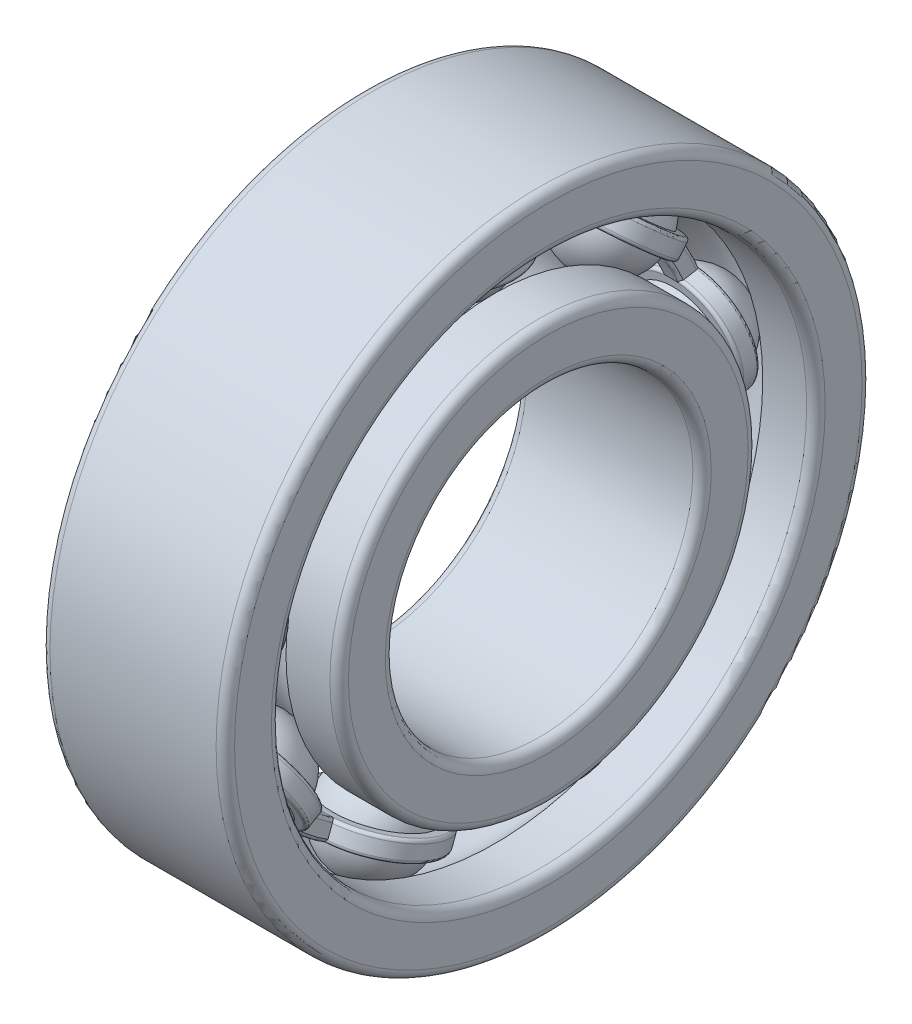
ISO-10303-21;
HEADER;
FILE_DESCRIPTION(('STEP AP214'),'2;1');
FILE_NAME('part.step','',(''),(''),'','','');
FILE_SCHEMA(('AUTOMOTIVE_DESIGN { 1 0 10303 214 1 1 1 1 }'));
ENDSEC;
DATA;
#1=APPLICATION_CONTEXT('core data for automotive mechanical design processes');
#2=APPLICATION_PROTOCOL_DEFINITION('international standard','automotive_design',2000,#1);
#3=PRODUCT_CONTEXT('',#1,'mechanical');
#4=PRODUCT('Part','Part','',(#3));
#5=PRODUCT_RELATED_PRODUCT_CATEGORY('part','',(#4));
#6=PRODUCT_DEFINITION_FORMATION('','',#4);
#7=PRODUCT_DEFINITION_CONTEXT('part definition',#1,'design');
#8=PRODUCT_DEFINITION('design','',#6,#7);
#9=PRODUCT_DEFINITION_SHAPE('','',#8);
#10=(LENGTH_UNIT() NAMED_UNIT(*) SI_UNIT(.MILLI.,.METRE.));
#11=(NAMED_UNIT(*) PLANE_ANGLE_UNIT() SI_UNIT($,.RADIAN.));
#12=(NAMED_UNIT(*) SI_UNIT($,.STERADIAN.) SOLID_ANGLE_UNIT());
#13=UNCERTAINTY_MEASURE_WITH_UNIT(LENGTH_MEASURE(1.E-05),#10,'distance_accuracy_value','');
#14=(GEOMETRIC_REPRESENTATION_CONTEXT(3) GLOBAL_UNCERTAINTY_ASSIGNED_CONTEXT((#13)) GLOBAL_UNIT_ASSIGNED_CONTEXT((#10,
#11,#12)) REPRESENTATION_CONTEXT('',''));
#15=CARTESIAN_POINT('',(0.,0.,0.));
#16=DIRECTION('',(0.,0.,1.));
#17=DIRECTION('',(1.,0.,0.));
#18=AXIS2_PLACEMENT_3D('',#15,#16,#17);
#19=CARTESIAN_POINT('',(0.,-7.75000000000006,13.4233937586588));
#20=DIRECTION('',(1.,0.,0.));
#21=DIRECTION('',(0.,0.500000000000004,-0.866025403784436));
#22=AXIS2_PLACEMENT_3D('',#19,#20,#21);
#23=SPHERICAL_SURFACE('',#22,3.175);
#24=CARTESIAN_POINT('',(3.175,-7.75000000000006,13.4233937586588));
#25=VERTEX_POINT('',#24);
#26=VERTEX_LOOP('',#25);
#27=FACE_BOUND('',#26,.T.);
#28=CARTESIAN_POINT('',(-3.175,-7.75000000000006,13.4233937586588));
#29=VERTEX_POINT('',#28);
#30=VERTEX_LOOP('',#29);
#31=FACE_BOUND('',#30,.T.);
#32=ADVANCED_FACE('P0_F16',(#27,#31),#23,.T.);
#33=CLOSED_SHELL('',(#32));
#34=MANIFOLD_SOLID_BREP('P0_B1',#33);
#35=CARTESIAN_POINT('',(0.,-14.5652356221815,-5.30131222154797));
#36=DIRECTION('',(1.,0.,0.));
#37=DIRECTION('',(0.,0.939692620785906,0.342020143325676));
#38=AXIS2_PLACEMENT_3D('',#35,#36,#37);
#39=SPHERICAL_SURFACE('',#38,3.175);
#40=CARTESIAN_POINT('',(3.175,-14.5652356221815,-5.30131222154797));
#41=VERTEX_POINT('',#40);
#42=VERTEX_LOOP('',#41);
#43=FACE_BOUND('',#42,.T.);
#44=CARTESIAN_POINT('',(-3.175,-14.5652356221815,-5.30131222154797));
#45=VERTEX_POINT('',#44);
#46=VERTEX_LOOP('',#45);
#47=FACE_BOUND('',#46,.T.);
#48=ADVANCED_FACE('P1_F16',(#43,#47),#39,.T.);
#49=CLOSED_SHELL('',(#48));
#50=MANIFOLD_SOLID_BREP('P1_B1',#49);
#51=CARTESIAN_POINT('',(0.,-14.9740019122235,5.45009098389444));
#52=DIRECTION('',(0.,-0.939692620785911,0.342020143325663));
#53=DIRECTION('',(0.,-0.342020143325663,-0.93969262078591));
#54=AXIS2_PLACEMENT_3D('',#51,#52,#53);
#55=TOROIDAL_SURFACE('',#54,3.61,0.2);
#56=CARTESIAN_POINT('',(0.,-14.9740019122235,5.45009098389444));
#57=DIRECTION('',(0.,-0.939692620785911,0.342020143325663));
#58=DIRECTION('',(0.,-0.342020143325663,-0.939692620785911));
#59=AXIS2_PLACEMENT_3D('',#56,#57,#58);
#60=CIRCLE('',#59,3.81);
#61=CARTESIAN_POINT('',(0.,-16.2770986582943,1.86986209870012));
#62=VERTEX_POINT('',#61);
#63=EDGE_CURVE('P2_E55',#62,#62,#60,.F.);
#64=ORIENTED_EDGE('',*,*,#63,.F.);
#65=EDGE_LOOP('',(#64));
#66=FACE_BOUND('',#65,.T.);
#67=CARTESIAN_POINT('',(0.,-15.1619404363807,5.51849501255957));
#68=DIRECTION('',(0.,0.939692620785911,-0.342020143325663));
#69=DIRECTION('',(0.,-0.342020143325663,-0.939692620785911));
#70=AXIS2_PLACEMENT_3D('',#67,#68,#69);
#71=CIRCLE('',#70,3.61);
#72=CARTESIAN_POINT('',(0.,-13.927247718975,8.91078537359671));
#73=VERTEX_POINT('',#72);
#74=CARTESIAN_POINT('',(0.,-16.3966331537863,2.12620465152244));
#75=VERTEX_POINT('',#74);
#76=EDGE_CURVE('P2_E47',#73,#75,#71,.F.);
#77=ORIENTED_EDGE('',*,*,#76,.F.);
#78=CARTESIAN_POINT('',(0.,-15.1619404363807,5.51849501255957));
#79=DIRECTION('',(0.,0.939692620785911,-0.342020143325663));
#80=DIRECTION('',(0.,0.342020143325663,0.93969262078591));
#81=AXIS2_PLACEMENT_3D('',#78,#79,#80);
#82=CIRCLE('',#81,3.61);
#83=EDGE_CURVE('P2_E45',#75,#73,#82,.F.);
#84=ORIENTED_EDGE('',*,*,#83,.F.);
#85=EDGE_LOOP('',(#77,#84));
#86=FACE_BOUND('',#85,.T.);
#87=ADVANCED_FACE('P2_F17',(#66,#86),#55,.T.);
#88=CARTESIAN_POINT('',(0.,-17.5487596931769,6.38722617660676));
#89=DIRECTION('',(0.,-0.939692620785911,0.342020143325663));
#90=DIRECTION('',(0.,-0.342020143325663,-0.939692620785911));
#91=AXIS2_PLACEMENT_3D('',#88,#89,#90);
#92=CYLINDRICAL_SURFACE('',#91,3.81);
#93=CARTESIAN_POINT('',(0.,-14.1564693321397,5.15253345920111));
#94=DIRECTION('',(0.,0.939692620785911,-0.342020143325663));
#95=DIRECTION('',(0.,0.342020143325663,0.93969262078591));
#96=AXIS2_PLACEMENT_3D('',#93,#94,#95);
#97=CIRCLE('',#96,3.81);
#98=CARTESIAN_POINT('',(0.,-12.853372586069,8.73276234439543));
#99=VERTEX_POINT('',#98);
#100=EDGE_CURVE('P2_E51',#99,#99,#97,.T.);
#101=ORIENTED_EDGE('',*,*,#100,.F.);
#102=EDGE_LOOP('',(#101));
#103=FACE_BOUND('',#102,.T.);
#104=ORIENTED_EDGE('',*,*,#63,.T.);
#105=EDGE_LOOP('',(#104));
#106=FACE_BOUND('',#105,.T.);
#107=ADVANCED_FACE('P2_F73',(#103,#106),#92,.T.);
#108=CARTESIAN_POINT('',(-3.81,-15.1619404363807,5.51849501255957));
#109=DIRECTION('',(0.,-0.939692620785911,0.342020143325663));
#110=DIRECTION('',(0.,-0.342020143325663,-0.939692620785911));
#111=AXIS2_PLACEMENT_3D('',#108,#109,#110);
#112=PLANE('',#111);
#113=CARTESIAN_POINT('',(0.,-15.1619404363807,5.51849501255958));
#114=DIRECTION('',(0.,-0.939692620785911,0.342020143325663));
#115=DIRECTION('',(0.,-0.342020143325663,-0.939692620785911));
#116=AXIS2_PLACEMENT_3D('',#113,#114,#115);
#117=CIRCLE('',#116,2.54);
#118=CARTESIAN_POINT('',(0.,-16.0306716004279,3.13167575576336));
#119=VERTEX_POINT('',#118);
#120=EDGE_CURVE('P2_E88',#119,#119,#117,.F.);
#121=ORIENTED_EDGE('',*,*,#120,.T.);
#122=EDGE_LOOP('',(#121));
#123=FACE_BOUND('',#122,.T.);
#124=ORIENTED_EDGE('',*,*,#83,.T.);
#125=ORIENTED_EDGE('',*,*,#76,.T.);
#126=EDGE_LOOP('',(#124,#125));
#127=FACE_BOUND('',#126,.T.);
#128=ADVANCED_FACE('P2_F54',(#123,#127),#112,.T.);
#129=CARTESIAN_POINT('',(0.,-14.1564693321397,5.15253345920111));
#130=DIRECTION('',(0.,0.939692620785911,-0.342020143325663));
#131=DIRECTION('',(0.,0.342020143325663,0.93969262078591));
#132=AXIS2_PLACEMENT_3D('',#129,#130,#131);
#133=TOROIDAL_SURFACE('',#132,3.61,0.2);
#134=ORIENTED_EDGE('',*,*,#100,.T.);
#135=EDGE_LOOP('',(#134));
#136=FACE_BOUND('',#135,.T.);
#137=CARTESIAN_POINT('',(0.,-13.9685308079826,5.08412943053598));
#138=DIRECTION('',(0.,-0.939692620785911,0.342020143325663));
#139=DIRECTION('',(0.,0.342020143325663,0.93969262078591));
#140=AXIS2_PLACEMENT_3D('',#137,#138,#139);
#141=CIRCLE('',#140,3.61);
#142=CARTESIAN_POINT('',(0.,-15.2032235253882,1.69183906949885));
#143=VERTEX_POINT('',#142);
#144=CARTESIAN_POINT('',(0.,-12.7338380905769,8.47641979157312));
#145=VERTEX_POINT('',#144);
#146=EDGE_CURVE('P2_E29',#143,#145,#141,.F.);
#147=ORIENTED_EDGE('',*,*,#146,.F.);
#148=CARTESIAN_POINT('',(0.,-13.9685308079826,5.08412943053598));
#149=DIRECTION('',(0.,-0.939692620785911,0.342020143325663));
#150=DIRECTION('',(0.,-0.342020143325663,-0.93969262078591));
#151=AXIS2_PLACEMENT_3D('',#148,#149,#150);
#152=CIRCLE('',#151,3.61);
#153=EDGE_CURVE('P2_E93',#145,#143,#152,.F.);
#154=ORIENTED_EDGE('',*,*,#153,.F.);
#155=EDGE_LOOP('',(#147,#154));
#156=FACE_BOUND('',#155,.T.);
#157=ADVANCED_FACE('P2_F72',(#136,#156),#133,.T.);
#158=CARTESIAN_POINT('',(0.,-17.5487596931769,6.38722617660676));
#159=DIRECTION('',(0.,-0.939692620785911,0.342020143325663));
#160=DIRECTION('',(0.,-0.342020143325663,-0.939692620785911));
#161=AXIS2_PLACEMENT_3D('',#158,#159,#160);
#162=CYLINDRICAL_SURFACE('',#161,2.54);
#163=ORIENTED_EDGE('',*,*,#120,.F.);
#164=EDGE_LOOP('',(#163));
#165=FACE_BOUND('',#164,.T.);
#166=CARTESIAN_POINT('',(0.,-13.9685308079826,5.08412943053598));
#167=DIRECTION('',(0.,-0.939692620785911,0.342020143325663));
#168=DIRECTION('',(0.,-0.342020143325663,-0.939692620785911));
#169=AXIS2_PLACEMENT_3D('',#166,#167,#168);
#170=CIRCLE('',#169,2.54);
#171=CARTESIAN_POINT('',(0.,-14.8372619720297,2.69731017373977));
#172=VERTEX_POINT('',#171);
#173=EDGE_CURVE('P2_E11',#172,#172,#170,.T.);
#174=ORIENTED_EDGE('',*,*,#173,.F.);
#175=EDGE_LOOP('',(#174));
#176=FACE_BOUND('',#175,.T.);
#177=ADVANCED_FACE('P2_F125',(#165,#176),#162,.F.);
#178=CARTESIAN_POINT('',(-3.81,-13.9685308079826,5.08412943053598));
#179=DIRECTION('',(0.,0.939692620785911,-0.342020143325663));
#180=DIRECTION('',(0.,0.342020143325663,0.939692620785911));
#181=AXIS2_PLACEMENT_3D('',#178,#179,#180);
#182=PLANE('',#181);
#183=ORIENTED_EDGE('',*,*,#173,.T.);
#184=EDGE_LOOP('',(#183));
#185=FACE_BOUND('',#184,.T.);
#186=ORIENTED_EDGE('',*,*,#153,.T.);
#187=ORIENTED_EDGE('',*,*,#146,.T.);
#188=EDGE_LOOP('',(#186,#187));
#189=FACE_BOUND('',#188,.T.);
#190=ADVANCED_FACE('P2_F109',(#185,#189),#182,.T.);
#191=CLOSED_SHELL('',(#87,#107,#128,#157,#177,#190));
#192=MANIFOLD_SOLID_BREP('P2_B1',#191);
#193=CARTESIAN_POINT('',(0.,-14.5652356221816,5.30131222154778));
#194=DIRECTION('',(1.,0.,0.));
#195=DIRECTION('',(0.,0.939692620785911,-0.342020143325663));
#196=AXIS2_PLACEMENT_3D('',#193,#194,#195);
#197=SPHERICAL_SURFACE('',#196,3.175);
#198=CARTESIAN_POINT('',(3.175,-14.5652356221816,5.30131222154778));
#199=VERTEX_POINT('',#198);
#200=VERTEX_LOOP('',#199);
#201=FACE_BOUND('',#200,.T.);
#202=CARTESIAN_POINT('',(-3.175,-14.5652356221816,5.30131222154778));
#203=VERTEX_POINT('',#202);
#204=VERTEX_LOOP('',#203);
#205=FACE_BOUND('',#204,.T.);
#206=ADVANCED_FACE('P3_F16',(#201,#205),#197,.T.);
#207=CLOSED_SHELL('',(#206));
#208=MANIFOLD_SOLID_BREP('P3_B1',#207);
#209=CARTESIAN_POINT('',(0.,-7.53250000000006,13.0466727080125));
#210=DIRECTION('',(0.,0.500000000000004,-0.866025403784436));
#211=DIRECTION('',(0.,0.866025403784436,0.500000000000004));
#212=AXIS2_PLACEMENT_3D('',#209,#210,#211);
#213=TOROIDAL_SURFACE('',#212,3.61,0.2);
#214=CARTESIAN_POINT('',(0.,-7.53250000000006,13.0466727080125));
#215=DIRECTION('',(0.,-0.500000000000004,0.866025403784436));
#216=DIRECTION('',(0.,-0.866025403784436,-0.500000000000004));
#217=AXIS2_PLACEMENT_3D('',#214,#215,#216);
#218=CIRCLE('',#217,3.81);
#219=CARTESIAN_POINT('',(0.,-10.8320567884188,11.1416727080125));
#220=VERTEX_POINT('',#219);
#221=EDGE_CURVE('P4_E55',#220,#220,#218,.T.);
#222=ORIENTED_EDGE('',*,*,#221,.F.);
#223=EDGE_LOOP('',(#222));
#224=FACE_BOUND('',#223,.T.);
#225=CARTESIAN_POINT('',(0.,-7.43250000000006,12.8734676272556));
#226=DIRECTION('',(0.,-0.500000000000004,0.866025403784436));
#227=DIRECTION('',(0.,0.866025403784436,0.500000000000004));
#228=AXIS2_PLACEMENT_3D('',#225,#226,#227);
#229=CIRCLE('',#228,3.61);
#230=CARTESIAN_POINT('',(0.,-10.5588517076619,11.0684676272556));
#231=VERTEX_POINT('',#230);
#232=CARTESIAN_POINT('',(0.,-4.30614829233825,14.6784676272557));
#233=VERTEX_POINT('',#232);
#234=EDGE_CURVE('P4_E47',#231,#233,#229,.F.);
#235=ORIENTED_EDGE('',*,*,#234,.F.);
#236=CARTESIAN_POINT('',(0.,-7.43250000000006,12.8734676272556));
#237=DIRECTION('',(0.,-0.500000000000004,0.866025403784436));
#238=DIRECTION('',(0.,-0.866025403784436,-0.500000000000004));
#239=AXIS2_PLACEMENT_3D('',#236,#237,#238);
#240=CIRCLE('',#239,3.61);
#241=EDGE_CURVE('P4_E45',#233,#231,#240,.F.);
#242=ORIENTED_EDGE('',*,*,#241,.F.);
#243=EDGE_LOOP('',(#235,#242));
#244=FACE_BOUND('',#243,.T.);
#245=ADVANCED_FACE('P4_F17',(#224,#244),#213,.T.);
#246=CARTESIAN_POINT('',(0.,-9.33750000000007,16.1730244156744));
#247=DIRECTION('',(0.,-0.500000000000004,0.866025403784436));
#248=DIRECTION('',(0.,-0.866025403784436,-0.500000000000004));
#249=AXIS2_PLACEMENT_3D('',#246,#247,#248);
#250=CYLINDRICAL_SURFACE('',#249,3.81);
#251=ORIENTED_EDGE('',*,*,#221,.T.);
#252=EDGE_LOOP('',(#251));
#253=FACE_BOUND('',#252,.T.);
#254=CARTESIAN_POINT('',(0.,-7.96750000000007,13.800114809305));
#255=DIRECTION('',(0.,-0.500000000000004,0.866025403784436));
#256=DIRECTION('',(0.,-0.866025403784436,-0.500000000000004));
#257=AXIS2_PLACEMENT_3D('',#254,#255,#256);
#258=CIRCLE('',#257,3.81);
#259=CARTESIAN_POINT('',(0.,-11.2670567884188,11.895114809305));
#260=VERTEX_POINT('',#259);
#261=EDGE_CURVE('P4_E51',#260,#260,#258,.T.);
#262=ORIENTED_EDGE('',*,*,#261,.F.);
#263=EDGE_LOOP('',(#262));
#264=FACE_BOUND('',#263,.T.);
#265=ADVANCED_FACE('P4_F73',(#253,#264),#250,.T.);
#266=CARTESIAN_POINT('',(-3.81,-7.43250000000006,12.8734676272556));
#267=DIRECTION('',(0.,0.500000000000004,-0.866025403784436));
#268=DIRECTION('',(0.,0.866025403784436,0.500000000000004));
#269=AXIS2_PLACEMENT_3D('',#266,#267,#268);
#270=PLANE('',#269);
#271=CARTESIAN_POINT('',(0.,-7.43250000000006,12.8734676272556));
#272=DIRECTION('',(0.,-0.500000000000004,0.866025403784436));
#273=DIRECTION('',(0.,-0.866025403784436,-0.500000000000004));
#274=AXIS2_PLACEMENT_3D('',#271,#272,#273);
#275=CIRCLE('',#274,2.54);
#276=CARTESIAN_POINT('',(0.,-9.63220452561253,11.6034676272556));
#277=VERTEX_POINT('',#276);
#278=EDGE_CURVE('P4_E88',#277,#277,#275,.T.);
#279=ORIENTED_EDGE('',*,*,#278,.T.);
#280=EDGE_LOOP('',(#279));
#281=FACE_BOUND('',#280,.T.);
#282=ORIENTED_EDGE('',*,*,#241,.T.);
#283=ORIENTED_EDGE('',*,*,#234,.T.);
#284=EDGE_LOOP('',(#282,#283));
#285=FACE_BOUND('',#284,.T.);
#286=ADVANCED_FACE('P4_F54',(#281,#285),#270,.T.);
#287=CARTESIAN_POINT('',(0.,-7.96750000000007,13.800114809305));
#288=DIRECTION('',(0.,-0.500000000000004,0.866025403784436));
#289=DIRECTION('',(0.,-0.866025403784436,-0.500000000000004));
#290=AXIS2_PLACEMENT_3D('',#287,#288,#289);
#291=TOROIDAL_SURFACE('',#290,3.61,0.2);
#292=ORIENTED_EDGE('',*,*,#261,.T.);
#293=EDGE_LOOP('',(#292));
#294=FACE_BOUND('',#293,.T.);
#295=CARTESIAN_POINT('',(0.,-8.06750000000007,13.9733198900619));
#296=DIRECTION('',(0.,0.500000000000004,-0.866025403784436));
#297=DIRECTION('',(0.,-0.866025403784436,-0.500000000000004));
#298=AXIS2_PLACEMENT_3D('',#295,#296,#297);
#299=CIRCLE('',#298,3.61);
#300=CARTESIAN_POINT('',(0.,-4.94114829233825,15.7783198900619));
#301=VERTEX_POINT('',#300);
#302=CARTESIAN_POINT('',(0.,-11.1938517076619,12.1683198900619));
#303=VERTEX_POINT('',#302);
#304=EDGE_CURVE('P4_E29',#301,#303,#299,.F.);
#305=ORIENTED_EDGE('',*,*,#304,.F.);
#306=CARTESIAN_POINT('',(0.,-8.06750000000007,13.9733198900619));
#307=DIRECTION('',(0.,0.500000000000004,-0.866025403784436));
#308=DIRECTION('',(0.,0.866025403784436,0.500000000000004));
#309=AXIS2_PLACEMENT_3D('',#306,#307,#308);
#310=CIRCLE('',#309,3.61);
#311=EDGE_CURVE('P4_E93',#303,#301,#310,.F.);
#312=ORIENTED_EDGE('',*,*,#311,.F.);
#313=EDGE_LOOP('',(#305,#312));
#314=FACE_BOUND('',#313,.T.);
#315=ADVANCED_FACE('P4_F72',(#294,#314),#291,.T.);
#316=CARTESIAN_POINT('',(0.,-9.33750000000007,16.1730244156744));
#317=DIRECTION('',(0.,-0.500000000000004,0.866025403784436));
#318=DIRECTION('',(0.,-0.866025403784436,-0.500000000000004));
#319=AXIS2_PLACEMENT_3D('',#316,#317,#318);
#320=CYLINDRICAL_SURFACE('',#319,2.54);
#321=CARTESIAN_POINT('',(0.,-8.06750000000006,13.9733198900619));
#322=DIRECTION('',(0.,-0.500000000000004,0.866025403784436));
#323=DIRECTION('',(0.,-0.866025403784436,-0.500000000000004));
#324=AXIS2_PLACEMENT_3D('',#321,#322,#323);
#325=CIRCLE('',#324,2.54);
#326=CARTESIAN_POINT('',(0.,-10.2672045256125,12.7033198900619));
#327=VERTEX_POINT('',#326);
#328=EDGE_CURVE('P4_E11',#327,#327,#325,.F.);
#329=ORIENTED_EDGE('',*,*,#328,.F.);
#330=EDGE_LOOP('',(#329));
#331=FACE_BOUND('',#330,.T.);
#332=ORIENTED_EDGE('',*,*,#278,.F.);
#333=EDGE_LOOP('',(#332));
#334=FACE_BOUND('',#333,.T.);
#335=ADVANCED_FACE('P4_F125',(#331,#334),#320,.F.);
#336=CARTESIAN_POINT('',(-3.81,-8.06750000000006,13.9733198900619));
#337=DIRECTION('',(0.,-0.500000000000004,0.866025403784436));
#338=DIRECTION('',(0.,-0.866025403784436,-0.500000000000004));
#339=AXIS2_PLACEMENT_3D('',#336,#337,#338);
#340=PLANE('',#339);
#341=ORIENTED_EDGE('',*,*,#328,.T.);
#342=EDGE_LOOP('',(#341));
#343=FACE_BOUND('',#342,.T.);
#344=ORIENTED_EDGE('',*,*,#311,.T.);
#345=ORIENTED_EDGE('',*,*,#304,.T.);
#346=EDGE_LOOP('',(#344,#345));
#347=FACE_BOUND('',#346,.T.);
#348=ADVANCED_FACE('P4_F109',(#343,#347),#340,.T.);
#349=CLOSED_SHELL('',(#245,#265,#286,#315,#335,#348));
#350=MANIFOLD_SOLID_BREP('P4_B1',#349);
#351=CARTESIAN_POINT('',(0.,0.,0.));
#352=DIRECTION('',(-1.,0.,0.));
#353=DIRECTION('',(0.,0.,1.));
#354=AXIS2_PLACEMENT_3D('',#351,#352,#353);
#355=TOROIDAL_SURFACE('',#354,15.5,3.175);
#356=CARTESIAN_POINT('',(-2.54,0.,0.));
#357=DIRECTION('',(-1.,0.,0.));
#358=DIRECTION('',(0.,0.,1.));
#359=AXIS2_PLACEMENT_3D('',#356,#357,#358);
#360=CIRCLE('',#359,13.595);
#361=CARTESIAN_POINT('',(-2.54,0.,13.595));
#362=VERTEX_POINT('',#361);
#363=EDGE_CURVE('P5_E130',#362,#362,#360,.T.);
#364=ORIENTED_EDGE('',*,*,#363,.F.);
#365=EDGE_LOOP('',(#364));
#366=FACE_BOUND('',#365,.T.);
#367=CARTESIAN_POINT('',(2.54,0.,0.));
#368=DIRECTION('',(-1.,0.,0.));
#369=DIRECTION('',(0.,0.,1.));
#370=AXIS2_PLACEMENT_3D('',#367,#368,#369);
#371=CIRCLE('',#370,13.595);
#372=CARTESIAN_POINT('',(2.54,0.,13.595));
#373=VERTEX_POINT('',#372);
#374=EDGE_CURVE('P5_E128',#373,#373,#371,.F.);
#375=ORIENTED_EDGE('',*,*,#374,.F.);
#376=EDGE_LOOP('',(#375));
#377=FACE_BOUND('',#376,.T.);
#378=ADVANCED_FACE('P5_F17',(#366,#377),#355,.F.);
#379=CARTESIAN_POINT('',(0.,0.,0.));
#380=DIRECTION('',(-1.,0.,0.));
#381=DIRECTION('',(0.,0.,1.));
#382=AXIS2_PLACEMENT_3D('',#379,#380,#381);
#383=CYLINDRICAL_SURFACE('',#382,13.595);
#384=CARTESIAN_POINT('',(-5.4,0.,0.));
#385=DIRECTION('',(-1.,0.,0.));
#386=DIRECTION('',(0.,0.,1.));
#387=AXIS2_PLACEMENT_3D('',#384,#385,#386);
#388=CIRCLE('',#387,13.595);
#389=CARTESIAN_POINT('',(-5.4,0.,13.595));
#390=VERTEX_POINT('',#389);
#391=EDGE_CURVE('P5_E125',#390,#390,#388,.T.);
#392=ORIENTED_EDGE('',*,*,#391,.F.);
#393=EDGE_LOOP('',(#392));
#394=FACE_BOUND('',#393,.T.);
#395=ORIENTED_EDGE('',*,*,#363,.T.);
#396=EDGE_LOOP('',(#395));
#397=FACE_BOUND('',#396,.T.);
#398=ADVANCED_FACE('P5_F318',(#394,#397),#383,.T.);
#399=CARTESIAN_POINT('',(0.,0.,0.));
#400=DIRECTION('',(-1.,0.,0.));
#401=DIRECTION('',(0.,0.,1.));
#402=AXIS2_PLACEMENT_3D('',#399,#400,#401);
#403=CYLINDRICAL_SURFACE('',#402,13.595);
#404=ORIENTED_EDGE('',*,*,#374,.T.);
#405=EDGE_LOOP('',(#404));
#406=FACE_BOUND('',#405,.T.);
#407=CARTESIAN_POINT('',(5.39999999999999,0.,0.));
#408=DIRECTION('',(-1.,0.,0.));
#409=DIRECTION('',(0.,0.,1.));
#410=AXIS2_PLACEMENT_3D('',#407,#408,#409);
#411=CIRCLE('',#410,13.595);
#412=CARTESIAN_POINT('',(5.39999999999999,0.,13.595));
#413=VERTEX_POINT('',#412);
#414=EDGE_CURVE('P5_E72',#413,#413,#411,.F.);
#415=ORIENTED_EDGE('',*,*,#414,.F.);
#416=EDGE_LOOP('',(#415));
#417=FACE_BOUND('',#416,.T.);
#418=ADVANCED_FACE('P5_F311',(#406,#417),#403,.T.);
#419=CARTESIAN_POINT('',(-5.4,0.,0.));
#420=DIRECTION('',(-1.,0.,0.));
#421=DIRECTION('',(0.,0.,1.));
#422=AXIS2_PLACEMENT_3D('',#419,#420,#421);
#423=TOROIDAL_SURFACE('',#422,12.995,0.600000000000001);
#424=CARTESIAN_POINT('',(-6.,0.,0.));
#425=DIRECTION('',(1.,0.,0.));
#426=DIRECTION('',(0.,0.,1.));
#427=AXIS2_PLACEMENT_3D('',#424,#425,#426);
#428=CIRCLE('',#427,12.995);
#429=CARTESIAN_POINT('',(-6.,0.,12.995));
#430=VERTEX_POINT('',#429);
#431=CARTESIAN_POINT('',(-6.,0.,-12.995));
#432=VERTEX_POINT('',#431);
#433=EDGE_CURVE('P5_E58',#430,#432,#428,.T.);
#434=ORIENTED_EDGE('',*,*,#433,.T.);
#435=CARTESIAN_POINT('',(-6.,0.,0.));
#436=DIRECTION('',(1.,0.,0.));
#437=DIRECTION('',(0.,0.,-1.));
#438=AXIS2_PLACEMENT_3D('',#435,#436,#437);
#439=CIRCLE('',#438,12.995);
#440=EDGE_CURVE('P5_E61',#432,#430,#439,.T.);
#441=ORIENTED_EDGE('',*,*,#440,.T.);
#442=EDGE_LOOP('',(#434,#441));
#443=FACE_BOUND('',#442,.T.);
#444=ORIENTED_EDGE('',*,*,#391,.T.);
#445=EDGE_LOOP('',(#444));
#446=FACE_BOUND('',#445,.T.);
#447=ADVANCED_FACE('P5_F70',(#443,#446),#423,.T.);
#448=CARTESIAN_POINT('',(5.39999999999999,0.,0.));
#449=DIRECTION('',(-1.,0.,0.));
#450=DIRECTION('',(0.,0.,1.));
#451=AXIS2_PLACEMENT_3D('',#448,#449,#450);
#452=TOROIDAL_SURFACE('',#451,12.995,0.600000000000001);
#453=ORIENTED_EDGE('',*,*,#414,.T.);
#454=EDGE_LOOP('',(#453));
#455=FACE_BOUND('',#454,.T.);
#456=CARTESIAN_POINT('',(5.99999999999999,0.,0.));
#457=DIRECTION('',(-1.,0.,0.));
#458=DIRECTION('',(0.,0.,1.));
#459=AXIS2_PLACEMENT_3D('',#456,#457,#458);
#460=CIRCLE('',#459,12.995);
#461=CARTESIAN_POINT('',(5.99999999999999,0.,12.995));
#462=VERTEX_POINT('',#461);
#463=CARTESIAN_POINT('',(5.99999999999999,0.,-12.995));
#464=VERTEX_POINT('',#463);
#465=EDGE_CURVE('P5_E105',#462,#464,#460,.T.);
#466=ORIENTED_EDGE('',*,*,#465,.T.);
#467=CARTESIAN_POINT('',(5.99999999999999,0.,0.));
#468=DIRECTION('',(-1.,0.,0.));
#469=DIRECTION('',(0.,0.,-1.));
#470=AXIS2_PLACEMENT_3D('',#467,#468,#469);
#471=CIRCLE('',#470,12.995);
#472=EDGE_CURVE('P5_E165',#464,#462,#471,.T.);
#473=ORIENTED_EDGE('',*,*,#472,.T.);
#474=EDGE_LOOP('',(#466,#473));
#475=FACE_BOUND('',#474,.T.);
#476=ADVANCED_FACE('P5_F80',(#455,#475),#452,.T.);
#477=CARTESIAN_POINT('',(-6.,12.995,0.));
#478=DIRECTION('',(1.,0.,0.));
#479=DIRECTION('',(0.,0.,-1.));
#480=AXIS2_PLACEMENT_3D('',#477,#478,#479);
#481=PLANE('',#480);
#482=ORIENTED_EDGE('',*,*,#433,.F.);
#483=ORIENTED_EDGE('',*,*,#440,.F.);
#484=EDGE_LOOP('',(#482,#483));
#485=FACE_BOUND('',#484,.T.);
#486=CARTESIAN_POINT('',(-6.,0.,0.));
#487=DIRECTION('',(-1.,0.,0.));
#488=DIRECTION('',(0.,0.,-1.));
#489=AXIS2_PLACEMENT_3D('',#486,#487,#488);
#490=CIRCLE('',#489,10.6);
#491=CARTESIAN_POINT('',(-6.,0.,-10.6));
#492=VERTEX_POINT('',#491);
#493=CARTESIAN_POINT('',(-6.,0.,10.6));
#494=VERTEX_POINT('',#493);
#495=EDGE_CURVE('P5_E213',#492,#494,#490,.T.);
#496=ORIENTED_EDGE('',*,*,#495,.F.);
#497=CARTESIAN_POINT('',(-6.,0.,0.));
#498=DIRECTION('',(-1.,0.,0.));
#499=DIRECTION('',(0.,0.,1.));
#500=AXIS2_PLACEMENT_3D('',#497,#498,#499);
#501=CIRCLE('',#500,10.6);
#502=EDGE_CURVE('P5_E67',#494,#492,#501,.T.);
#503=ORIENTED_EDGE('',*,*,#502,.F.);
#504=EDGE_LOOP('',(#496,#503));
#505=FACE_BOUND('',#504,.T.);
#506=ADVANCED_FACE('P5_F63',(#485,#505),#481,.F.);
#507=CARTESIAN_POINT('',(6.,12.995,0.));
#508=DIRECTION('',(-1.,0.,0.));
#509=DIRECTION('',(0.,0.,1.));
#510=AXIS2_PLACEMENT_3D('',#507,#508,#509);
#511=PLANE('',#510);
#512=CARTESIAN_POINT('',(6.,0.,0.));
#513=DIRECTION('',(1.,0.,0.));
#514=DIRECTION('',(0.,0.,1.));
#515=AXIS2_PLACEMENT_3D('',#512,#513,#514);
#516=CIRCLE('',#515,10.6);
#517=CARTESIAN_POINT('',(6.,0.,10.6));
#518=VERTEX_POINT('',#517);
#519=CARTESIAN_POINT('',(6.,0.,-10.6));
#520=VERTEX_POINT('',#519);
#521=EDGE_CURVE('P5_E185',#518,#520,#516,.T.);
#522=ORIENTED_EDGE('',*,*,#521,.F.);
#523=CARTESIAN_POINT('',(6.,0.,0.));
#524=DIRECTION('',(1.,0.,0.));
#525=DIRECTION('',(0.,0.,-1.));
#526=AXIS2_PLACEMENT_3D('',#523,#524,#525);
#527=CIRCLE('',#526,10.6);
#528=EDGE_CURVE('P5_E37',#520,#518,#527,.T.);
#529=ORIENTED_EDGE('',*,*,#528,.F.);
#530=EDGE_LOOP('',(#522,#529));
#531=FACE_BOUND('',#530,.T.);
#532=ORIENTED_EDGE('',*,*,#472,.F.);
#533=ORIENTED_EDGE('',*,*,#465,.F.);
#534=EDGE_LOOP('',(#532,#533));
#535=FACE_BOUND('',#534,.T.);
#536=ADVANCED_FACE('P5_F153',(#531,#535),#511,.F.);
#537=CARTESIAN_POINT('',(-5.4,0.,0.));
#538=DIRECTION('',(-1.,0.,0.));
#539=DIRECTION('',(0.,0.,1.));
#540=AXIS2_PLACEMENT_3D('',#537,#538,#539);
#541=TOROIDAL_SURFACE('',#540,10.6,0.600000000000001);
#542=ORIENTED_EDGE('',*,*,#502,.T.);
#543=ORIENTED_EDGE('',*,*,#495,.T.);
#544=EDGE_LOOP('',(#542,#543));
#545=FACE_BOUND('',#544,.T.);
#546=CARTESIAN_POINT('',(-5.4,0.,0.));
#547=DIRECTION('',(-1.,0.,0.));
#548=DIRECTION('',(0.,0.,1.));
#549=AXIS2_PLACEMENT_3D('',#546,#547,#548);
#550=CIRCLE('',#549,10.);
#551=CARTESIAN_POINT('',(-5.4,0.,10.));
#552=VERTEX_POINT('',#551);
#553=EDGE_CURVE('P5_E29',#552,#552,#550,.F.);
#554=ORIENTED_EDGE('',*,*,#553,.T.);
#555=EDGE_LOOP('',(#554));
#556=FACE_BOUND('',#555,.T.);
#557=ADVANCED_FACE('P5_F142',(#545,#556),#541,.T.);
#558=CARTESIAN_POINT('',(5.4,0.,0.));
#559=DIRECTION('',(-1.,0.,0.));
#560=DIRECTION('',(0.,0.,1.));
#561=AXIS2_PLACEMENT_3D('',#558,#559,#560);
#562=TOROIDAL_SURFACE('',#561,10.6,0.6);
#563=ORIENTED_EDGE('',*,*,#521,.T.);
#564=ORIENTED_EDGE('',*,*,#528,.T.);
#565=EDGE_LOOP('',(#563,#564));
#566=FACE_BOUND('',#565,.T.);
#567=CARTESIAN_POINT('',(5.4,0.,0.));
#568=DIRECTION('',(-1.,0.,0.));
#569=DIRECTION('',(0.,0.,1.));
#570=AXIS2_PLACEMENT_3D('',#567,#568,#569);
#571=CIRCLE('',#570,10.);
#572=CARTESIAN_POINT('',(5.4,0.,10.));
#573=VERTEX_POINT('',#572);
#574=EDGE_CURVE('P5_E11',#573,#573,#571,.T.);
#575=ORIENTED_EDGE('',*,*,#574,.T.);
#576=EDGE_LOOP('',(#575));
#577=FACE_BOUND('',#576,.T.);
#578=ADVANCED_FACE('P5_F152',(#566,#577),#562,.T.);
#579=CARTESIAN_POINT('',(0.,0.,0.));
#580=DIRECTION('',(-1.,0.,0.));
#581=DIRECTION('',(0.,0.,1.));
#582=AXIS2_PLACEMENT_3D('',#579,#580,#581);
#583=CYLINDRICAL_SURFACE('',#582,10.);
#584=ORIENTED_EDGE('',*,*,#553,.F.);
#585=EDGE_LOOP('',(#584));
#586=FACE_BOUND('',#585,.T.);
#587=ORIENTED_EDGE('',*,*,#574,.F.);
#588=EDGE_LOOP('',(#587));
#589=FACE_BOUND('',#588,.T.);
#590=ADVANCED_FACE('P5_F256',(#586,#589),#583,.F.);
#591=CLOSED_SHELL('',(#378,#398,#418,#447,#476,#506,#536,#557,#578,#590));
#592=MANIFOLD_SOLID_BREP('P5_B1',#591);
#593=CARTESIAN_POINT('',(0.,2.76708371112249,15.6929115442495));
#594=DIRECTION('',(0.,0.173648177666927,0.984807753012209));
#595=DIRECTION('',(0.,-0.984807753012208,0.173648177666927));
#596=AXIS2_PLACEMENT_3D('',#593,#594,#595);
#597=TOROIDAL_SURFACE('',#596,3.61,0.2);
#598=CARTESIAN_POINT('',(0.,2.76708371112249,15.6929115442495));
#599=DIRECTION('',(0.,0.173648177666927,0.984807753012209));
#600=DIRECTION('',(0.,-0.984807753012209,0.173648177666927));
#601=AXIS2_PLACEMENT_3D('',#598,#599,#600);
#602=CIRCLE('',#601,3.81);
#603=CARTESIAN_POINT('',(0.,-0.985033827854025,16.3545111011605));
#604=VERTEX_POINT('',#603);
#605=EDGE_CURVE('P6_E55',#604,#604,#602,.F.);
#606=ORIENTED_EDGE('',*,*,#605,.F.);
#607=EDGE_LOOP('',(#606));
#608=FACE_BOUND('',#607,.T.);
#609=CARTESIAN_POINT('',(0.,2.80181334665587,15.889873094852));
#610=DIRECTION('',(0.,-0.173648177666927,-0.984807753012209));
#611=DIRECTION('',(0.,-0.984807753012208,0.173648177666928));
#612=AXIS2_PLACEMENT_3D('',#609,#610,#611);
#613=CIRCLE('',#612,3.61);
#614=CARTESIAN_POINT('',(0.,6.35696933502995,15.2630031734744));
#615=VERTEX_POINT('',#614);
#616=CARTESIAN_POINT('',(0.,-0.753342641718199,16.5167430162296));
#617=VERTEX_POINT('',#616);
#618=EDGE_CURVE('P6_E47',#615,#617,#613,.F.);
#619=ORIENTED_EDGE('',*,*,#618,.F.);
#620=CARTESIAN_POINT('',(0.,2.80181334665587,15.889873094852));
#621=DIRECTION('',(0.,-0.173648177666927,-0.984807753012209));
#622=DIRECTION('',(0.,0.984807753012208,-0.173648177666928));
#623=AXIS2_PLACEMENT_3D('',#620,#621,#622);
#624=CIRCLE('',#623,3.61);
#625=EDGE_CURVE('P6_E45',#617,#615,#624,.F.);
#626=ORIENTED_EDGE('',*,*,#625,.F.);
#627=EDGE_LOOP('',(#619,#626));
#628=FACE_BOUND('',#627,.T.);
#629=ADVANCED_FACE('P6_F17',(#608,#628),#597,.T.);
#630=CARTESIAN_POINT('',(0.,3.24287971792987,18.391284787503));
#631=DIRECTION('',(0.,0.173648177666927,0.984807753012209));
#632=DIRECTION('',(0.,-0.984807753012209,0.173648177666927));
#633=AXIS2_PLACEMENT_3D('',#630,#631,#632);
#634=CYLINDRICAL_SURFACE('',#633,3.81);
#635=CARTESIAN_POINT('',(0.,2.61600979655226,14.8361287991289));
#636=DIRECTION('',(0.,-0.173648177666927,-0.984807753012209));
#637=DIRECTION('',(0.,0.984807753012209,-0.173648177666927));
#638=AXIS2_PLACEMENT_3D('',#635,#636,#637);
#639=CIRCLE('',#638,3.81);
#640=CARTESIAN_POINT('',(0.,6.36812733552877,14.1745292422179));
#641=VERTEX_POINT('',#640);
#642=EDGE_CURVE('P6_E51',#641,#641,#639,.T.);
#643=ORIENTED_EDGE('',*,*,#642,.F.);
#644=EDGE_LOOP('',(#643));
#645=FACE_BOUND('',#644,.T.);
#646=ORIENTED_EDGE('',*,*,#605,.T.);
#647=EDGE_LOOP('',(#646));
#648=FACE_BOUND('',#647,.T.);
#649=ADVANCED_FACE('P6_F73',(#645,#648),#634,.T.);
#650=CARTESIAN_POINT('',(-3.81,2.80181334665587,15.889873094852));
#651=DIRECTION('',(0.,0.173648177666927,0.984807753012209));
#652=DIRECTION('',(0.,-0.984807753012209,0.173648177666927));
#653=AXIS2_PLACEMENT_3D('',#650,#651,#652);
#654=PLANE('',#653);
#655=CARTESIAN_POINT('',(0.,2.80181334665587,15.889873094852));
#656=DIRECTION('',(0.,0.173648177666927,0.984807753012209));
#657=DIRECTION('',(0.,-0.984807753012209,0.173648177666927));
#658=AXIS2_PLACEMENT_3D('',#655,#656,#657);
#659=CIRCLE('',#658,2.54);
#660=CARTESIAN_POINT('',(0.,0.300401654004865,16.330939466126));
#661=VERTEX_POINT('',#660);
#662=EDGE_CURVE('P6_E88',#661,#661,#659,.F.);
#663=ORIENTED_EDGE('',*,*,#662,.T.);
#664=EDGE_LOOP('',(#663));
#665=FACE_BOUND('',#664,.T.);
#666=ORIENTED_EDGE('',*,*,#625,.T.);
#667=ORIENTED_EDGE('',*,*,#618,.T.);
#668=EDGE_LOOP('',(#666,#667));
#669=FACE_BOUND('',#668,.T.);
#670=ADVANCED_FACE('P6_F54',(#665,#669),#654,.T.);
#671=CARTESIAN_POINT('',(0.,2.61600979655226,14.8361287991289));
#672=DIRECTION('',(0.,-0.173648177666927,-0.984807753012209));
#673=DIRECTION('',(0.,0.984807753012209,-0.173648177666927));
#674=AXIS2_PLACEMENT_3D('',#671,#672,#673);
#675=TOROIDAL_SURFACE('',#674,3.61,0.2);
#676=ORIENTED_EDGE('',*,*,#642,.T.);
#677=EDGE_LOOP('',(#676));
#678=FACE_BOUND('',#677,.T.);
#679=CARTESIAN_POINT('',(0.,2.58128016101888,14.6391672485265));
#680=DIRECTION('',(0.,0.173648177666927,0.984807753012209));
#681=DIRECTION('',(0.,0.984807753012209,-0.173648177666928));
#682=AXIS2_PLACEMENT_3D('',#679,#680,#681);
#683=CIRCLE('',#682,3.61);
#684=CARTESIAN_POINT('',(0.,-0.973875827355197,15.2660371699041));
#685=VERTEX_POINT('',#684);
#686=CARTESIAN_POINT('',(0.,6.13643614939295,14.0122973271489));
#687=VERTEX_POINT('',#686);
#688=EDGE_CURVE('P6_E29',#685,#687,#683,.F.);
#689=ORIENTED_EDGE('',*,*,#688,.F.);
#690=CARTESIAN_POINT('',(0.,2.58128016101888,14.6391672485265));
#691=DIRECTION('',(0.,0.173648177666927,0.984807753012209));
#692=DIRECTION('',(0.,-0.984807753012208,0.173648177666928));
#693=AXIS2_PLACEMENT_3D('',#690,#691,#692);
#694=CIRCLE('',#693,3.61);
#695=EDGE_CURVE('P6_E93',#687,#685,#694,.F.);
#696=ORIENTED_EDGE('',*,*,#695,.F.);
#697=EDGE_LOOP('',(#689,#696));
#698=FACE_BOUND('',#697,.T.);
#699=ADVANCED_FACE('P6_F72',(#678,#698),#675,.T.);
#700=CARTESIAN_POINT('',(0.,3.24287971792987,18.391284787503));
#701=DIRECTION('',(0.,0.173648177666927,0.984807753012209));
#702=DIRECTION('',(0.,-0.984807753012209,0.173648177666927));
#703=AXIS2_PLACEMENT_3D('',#700,#701,#702);
#704=CYLINDRICAL_SURFACE('',#703,2.54);
#705=ORIENTED_EDGE('',*,*,#662,.F.);
#706=EDGE_LOOP('',(#705));
#707=FACE_BOUND('',#706,.T.);
#708=CARTESIAN_POINT('',(0.,2.58128016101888,14.6391672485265));
#709=DIRECTION('',(0.,0.173648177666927,0.984807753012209));
#710=DIRECTION('',(0.,-0.984807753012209,0.173648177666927));
#711=AXIS2_PLACEMENT_3D('',#708,#709,#710);
#712=CIRCLE('',#711,2.54);
#713=CARTESIAN_POINT('',(0.,0.0798684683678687,15.0802336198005));
#714=VERTEX_POINT('',#713);
#715=EDGE_CURVE('P6_E11',#714,#714,#712,.T.);
#716=ORIENTED_EDGE('',*,*,#715,.F.);
#717=EDGE_LOOP('',(#716));
#718=FACE_BOUND('',#717,.T.);
#719=ADVANCED_FACE('P6_F125',(#707,#718),#704,.F.);
#720=CARTESIAN_POINT('',(-3.81,2.58128016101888,14.6391672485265));
#721=DIRECTION('',(0.,-0.173648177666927,-0.984807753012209));
#722=DIRECTION('',(0.,0.984807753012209,-0.173648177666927));
#723=AXIS2_PLACEMENT_3D('',#720,#721,#722);
#724=PLANE('',#723);
#725=ORIENTED_EDGE('',*,*,#715,.T.);
#726=EDGE_LOOP('',(#725));
#727=FACE_BOUND('',#726,.T.);
#728=ORIENTED_EDGE('',*,*,#695,.T.);
#729=ORIENTED_EDGE('',*,*,#688,.T.);
#730=EDGE_LOOP('',(#728,#729));
#731=FACE_BOUND('',#730,.T.);
#732=ADVANCED_FACE('P6_F109',(#727,#731),#724,.T.);
#733=CLOSED_SHELL('',(#629,#649,#670,#699,#719,#732));
#734=MANIFOLD_SOLID_BREP('P6_B1',#733);
#735=CARTESIAN_POINT('',(0.,11.5404595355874,9.68359533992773));
#736=DIRECTION('',(0.,-0.766044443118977,-0.642787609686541));
#737=DIRECTION('',(0.,0.64278760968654,-0.766044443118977));
#738=AXIS2_PLACEMENT_3D('',#735,#736,#737);
#739=TOROIDAL_SURFACE('',#738,3.61,0.2);
#740=CARTESIAN_POINT('',(0.,11.5404595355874,9.68359533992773));
#741=DIRECTION('',(0.,0.766044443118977,0.642787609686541));
#742=DIRECTION('',(0.,-0.642787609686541,0.766044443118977));
#743=AXIS2_PLACEMENT_3D('',#740,#741,#742);
#744=CIRCLE('',#743,3.81);
#745=CARTESIAN_POINT('',(0.,9.09143874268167,12.602224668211));
#746=VERTEX_POINT('',#745);
#747=EDGE_CURVE('P7_E55',#746,#746,#744,.T.);
#748=ORIENTED_EDGE('',*,*,#747,.F.);
#749=EDGE_LOOP('',(#748));
#750=FACE_BOUND('',#749,.T.);
#751=CARTESIAN_POINT('',(0.,11.3872506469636,9.55503781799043));
#752=DIRECTION('',(0.,0.766044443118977,0.642787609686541));
#753=DIRECTION('',(0.,0.64278760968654,-0.766044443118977));
#754=AXIS2_PLACEMENT_3D('',#751,#752,#753);
#755=CIRCLE('',#754,3.61);
#756=CARTESIAN_POINT('',(0.,9.06678737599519,12.3204582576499));
#757=VERTEX_POINT('',#756);
#758=CARTESIAN_POINT('',(0.,13.707713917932,6.78961737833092));
#759=VERTEX_POINT('',#758);
#760=EDGE_CURVE('P7_E47',#757,#759,#755,.F.);
#761=ORIENTED_EDGE('',*,*,#760,.F.);
#762=CARTESIAN_POINT('',(0.,11.3872506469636,9.55503781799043));
#763=DIRECTION('',(0.,0.766044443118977,0.642787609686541));
#764=DIRECTION('',(0.,-0.64278760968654,0.766044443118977));
#765=AXIS2_PLACEMENT_3D('',#762,#763,#764);
#766=CIRCLE('',#765,3.61);
#767=EDGE_CURVE('P7_E45',#759,#757,#766,.F.);
#768=ORIENTED_EDGE('',*,*,#767,.F.);
#769=EDGE_LOOP('',(#761,#768));
#770=FACE_BOUND('',#769,.T.);
#771=ADVANCED_FACE('P7_F17',(#750,#770),#739,.T.);
#772=CARTESIAN_POINT('',(0.,14.3058799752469,12.0040586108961));
#773=DIRECTION('',(0.,0.766044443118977,0.642787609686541));
#774=DIRECTION('',(0.,-0.642787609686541,0.766044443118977));
#775=AXIS2_PLACEMENT_3D('',#772,#773,#774);
#776=CYLINDRICAL_SURFACE('',#775,3.81);
#777=ORIENTED_EDGE('',*,*,#747,.T.);
#778=EDGE_LOOP('',(#777));
#779=FACE_BOUND('',#778,.T.);
#780=CARTESIAN_POINT('',(0.,12.2069182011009,10.242820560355));
#781=DIRECTION('',(0.,0.766044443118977,0.642787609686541));
#782=DIRECTION('',(0.,-0.64278760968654,0.766044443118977));
#783=AXIS2_PLACEMENT_3D('',#780,#781,#782);
#784=CIRCLE('',#783,3.81);
#785=CARTESIAN_POINT('',(0.,9.75789740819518,13.1614498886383));
#786=VERTEX_POINT('',#785);
#787=EDGE_CURVE('P7_E51',#786,#786,#784,.T.);
#788=ORIENTED_EDGE('',*,*,#787,.F.);
#789=EDGE_LOOP('',(#788));
#790=FACE_BOUND('',#789,.T.);
#791=ADVANCED_FACE('P7_F73',(#779,#790),#776,.T.);
#792=CARTESIAN_POINT('',(-3.81,11.3872506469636,9.55503781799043));
#793=DIRECTION('',(0.,-0.766044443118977,-0.64278760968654));
#794=DIRECTION('',(0.,0.64278760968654,-0.766044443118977));
#795=AXIS2_PLACEMENT_3D('',#792,#793,#794);
#796=PLANE('',#795);
#797=CARTESIAN_POINT('',(0.,11.3872506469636,9.55503781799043));
#798=DIRECTION('',(0.,0.766044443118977,0.642787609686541));
#799=DIRECTION('',(0.,-0.642787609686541,0.766044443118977));
#800=AXIS2_PLACEMENT_3D('',#797,#798,#799);
#801=CIRCLE('',#800,2.54);
#802=CARTESIAN_POINT('',(0.,9.75457011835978,11.5007907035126));
#803=VERTEX_POINT('',#802);
#804=EDGE_CURVE('P7_E88',#803,#803,#801,.T.);
#805=ORIENTED_EDGE('',*,*,#804,.T.);
#806=EDGE_LOOP('',(#805));
#807=FACE_BOUND('',#806,.T.);
#808=ORIENTED_EDGE('',*,*,#767,.T.);
#809=ORIENTED_EDGE('',*,*,#760,.T.);
#810=EDGE_LOOP('',(#808,#809));
#811=FACE_BOUND('',#810,.T.);
#812=ADVANCED_FACE('P7_F54',(#807,#811),#796,.T.);
#813=CARTESIAN_POINT('',(0.,12.2069182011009,10.242820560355));
#814=DIRECTION('',(0.,0.766044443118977,0.642787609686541));
#815=DIRECTION('',(0.,-0.64278760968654,0.766044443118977));
#816=AXIS2_PLACEMENT_3D('',#813,#814,#815);
#817=TOROIDAL_SURFACE('',#816,3.61,0.2);
#818=ORIENTED_EDGE('',*,*,#787,.T.);
#819=EDGE_LOOP('',(#818));
#820=FACE_BOUND('',#819,.T.);
#821=CARTESIAN_POINT('',(0.,12.3601270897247,10.3713780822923));
#822=DIRECTION('',(0.,-0.766044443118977,-0.642787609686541));
#823=DIRECTION('',(0.,-0.64278760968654,0.766044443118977));
#824=AXIS2_PLACEMENT_3D('',#821,#822,#823);
#825=CIRCLE('',#824,3.61);
#826=CARTESIAN_POINT('',(0.,14.6805903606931,7.60595764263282));
#827=VERTEX_POINT('',#826);
#828=CARTESIAN_POINT('',(0.,10.0396638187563,13.1367985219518));
#829=VERTEX_POINT('',#828);
#830=EDGE_CURVE('P7_E29',#827,#829,#825,.F.);
#831=ORIENTED_EDGE('',*,*,#830,.F.);
#832=CARTESIAN_POINT('',(0.,12.3601270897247,10.3713780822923));
#833=DIRECTION('',(0.,-0.766044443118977,-0.642787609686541));
#834=DIRECTION('',(0.,0.64278760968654,-0.766044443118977));
#835=AXIS2_PLACEMENT_3D('',#832,#833,#834);
#836=CIRCLE('',#835,3.61);
#837=EDGE_CURVE('P7_E93',#829,#827,#836,.F.);
#838=ORIENTED_EDGE('',*,*,#837,.F.);
#839=EDGE_LOOP('',(#831,#838));
#840=FACE_BOUND('',#839,.T.);
#841=ADVANCED_FACE('P7_F72',(#820,#840),#817,.T.);
#842=CARTESIAN_POINT('',(0.,14.3058799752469,12.0040586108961));
#843=DIRECTION('',(0.,0.766044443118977,0.642787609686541));
#844=DIRECTION('',(0.,-0.642787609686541,0.766044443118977));
#845=AXIS2_PLACEMENT_3D('',#842,#843,#844);
#846=CYLINDRICAL_SURFACE('',#845,2.54);
#847=CARTESIAN_POINT('',(0.,12.3601270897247,10.3713780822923));
#848=DIRECTION('',(0.,0.766044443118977,0.642787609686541));
#849=DIRECTION('',(0.,-0.642787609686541,0.766044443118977));
#850=AXIS2_PLACEMENT_3D('',#847,#848,#849);
#851=CIRCLE('',#850,2.54);
#852=CARTESIAN_POINT('',(0.,10.7274465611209,12.3171309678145));
#853=VERTEX_POINT('',#852);
#854=EDGE_CURVE('P7_E11',#853,#853,#851,.F.);
#855=ORIENTED_EDGE('',*,*,#854,.F.);
#856=EDGE_LOOP('',(#855));
#857=FACE_BOUND('',#856,.T.);
#858=ORIENTED_EDGE('',*,*,#804,.F.);
#859=EDGE_LOOP('',(#858));
#860=FACE_BOUND('',#859,.T.);
#861=ADVANCED_FACE('P7_F125',(#857,#860),#846,.F.);
#862=CARTESIAN_POINT('',(-3.81,12.3601270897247,10.3713780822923));
#863=DIRECTION('',(0.,0.766044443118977,0.64278760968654));
#864=DIRECTION('',(0.,-0.64278760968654,0.766044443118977));
#865=AXIS2_PLACEMENT_3D('',#862,#863,#864);
#866=PLANE('',#865);
#867=ORIENTED_EDGE('',*,*,#854,.T.);
#868=EDGE_LOOP('',(#867));
#869=FACE_BOUND('',#868,.T.);
#870=ORIENTED_EDGE('',*,*,#837,.T.);
#871=ORIENTED_EDGE('',*,*,#830,.T.);
#872=EDGE_LOOP('',(#870,#871));
#873=FACE_BOUND('',#872,.T.);
#874=ADVANCED_FACE('P7_F109',(#869,#873),#866,.T.);
#875=CLOSED_SHELL('',(#771,#791,#812,#841,#861,#874));
#876=MANIFOLD_SOLID_BREP('P7_B1',#875);
#877=CARTESIAN_POINT('',(0.,2.69154675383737,15.2645201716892));
#878=DIRECTION('',(1.,0.,0.));
#879=DIRECTION('',(0.,-0.173648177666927,-0.984807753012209));
#880=AXIS2_PLACEMENT_3D('',#877,#878,#879);
#881=SPHERICAL_SURFACE('',#880,3.175);
#882=CARTESIAN_POINT('',(3.175,2.69154675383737,15.2645201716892));
#883=VERTEX_POINT('',#882);
#884=VERTEX_LOOP('',#883);
#885=FACE_BOUND('',#884,.T.);
#886=CARTESIAN_POINT('',(-3.175,2.69154675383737,15.2645201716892));
#887=VERTEX_POINT('',#886);
#888=VERTEX_LOOP('',#887);
#889=FACE_BOUND('',#888,.T.);
#890=ADVANCED_FACE('P8_F16',(#885,#889),#881,.T.);
#891=CLOSED_SHELL('',(#890));
#892=MANIFOLD_SOLID_BREP('P8_B1',#891);
#893=CARTESIAN_POINT('',(0.635,0.,0.));
#894=DIRECTION('',(1.,0.,0.));
#895=DIRECTION('',(0.,0.,-1.));
#896=AXIS2_PLACEMENT_3D('',#893,#894,#895);
#897=PLANE('',#896);
#898=CARTESIAN_POINT('',(0.635,0.,0.));
#899=DIRECTION('',(-1.,0.,0.));
#900=DIRECTION('',(0.,0.,1.));
#901=AXIS2_PLACEMENT_3D('',#898,#899,#900);
#902=CIRCLE('',#901,16.3339143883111);
#903=CARTESIAN_POINT('',(0.635,0.,16.3339143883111));
#904=VERTEX_POINT('',#903);
#905=CARTESIAN_POINT('',(0.635,0.,-16.3339143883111));
#906=VERTEX_POINT('',#905);
#907=EDGE_CURVE('P9_E61',#904,#906,#902,.T.);
#908=ORIENTED_EDGE('',*,*,#907,.F.);
#909=CARTESIAN_POINT('',(0.635,0.,0.));
#910=DIRECTION('',(-1.,0.,0.));
#911=DIRECTION('',(0.,0.,-1.));
#912=AXIS2_PLACEMENT_3D('',#909,#910,#911);
#913=CIRCLE('',#912,16.3339143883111);
#914=EDGE_CURVE('P9_E98',#906,#904,#913,.T.);
#915=ORIENTED_EDGE('',*,*,#914,.F.);
#916=EDGE_LOOP('',(#908,#915));
#917=FACE_BOUND('',#916,.T.);
#918=CARTESIAN_POINT('',(0.635,0.,0.));
#919=DIRECTION('',(1.,0.,0.));
#920=DIRECTION('',(0.,0.,1.));
#921=AXIS2_PLACEMENT_3D('',#918,#919,#920);
#922=CIRCLE('',#921,15.497069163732);
#923=CARTESIAN_POINT('',(0.635,0.,15.497069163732));
#924=VERTEX_POINT('',#923);
#925=CARTESIAN_POINT('',(0.635,0.,-15.497069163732));
#926=VERTEX_POINT('',#925);
#927=EDGE_CURVE('P9_E54',#924,#926,#922,.T.);
#928=ORIENTED_EDGE('',*,*,#927,.F.);
#929=CARTESIAN_POINT('',(0.635,0.,0.));
#930=DIRECTION('',(1.,0.,0.));
#931=DIRECTION('',(0.,0.,-1.));
#932=AXIS2_PLACEMENT_3D('',#929,#930,#931);
#933=CIRCLE('',#932,15.497069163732);
#934=EDGE_CURVE('P9_E56',#926,#924,#933,.T.);
#935=ORIENTED_EDGE('',*,*,#934,.F.);
#936=EDGE_LOOP('',(#928,#935));
#937=FACE_BOUND('',#936,.T.);
#938=ADVANCED_FACE('P9_F17',(#917,#937),#897,.T.);
#939=CARTESIAN_POINT('',(0.435,0.,0.));
#940=DIRECTION('',(1.,0.,0.));
#941=DIRECTION('',(0.,0.,-1.));
#942=AXIS2_PLACEMENT_3D('',#939,#940,#941);
#943=TOROIDAL_SURFACE('',#942,15.497069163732,0.2);
#944=CARTESIAN_POINT('',(0.435,0.,0.));
#945=DIRECTION('',(-1.,0.,0.));
#946=DIRECTION('',(0.,0.,1.));
#947=AXIS2_PLACEMENT_3D('',#944,#945,#946);
#948=CIRCLE('',#947,15.297069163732);
#949=CARTESIAN_POINT('',(0.435,0.,15.297069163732));
#950=VERTEX_POINT('',#949);
#951=EDGE_CURVE('P9_E130',#950,#950,#948,.T.);
#952=ORIENTED_EDGE('',*,*,#951,.T.);
#953=EDGE_LOOP('',(#952));
#954=FACE_BOUND('',#953,.T.);
#955=ORIENTED_EDGE('',*,*,#934,.T.);
#956=ORIENTED_EDGE('',*,*,#927,.T.);
#957=EDGE_LOOP('',(#955,#956));
#958=FACE_BOUND('',#957,.T.);
#959=ADVANCED_FACE('P9_F58',(#954,#958),#943,.T.);
#960=CARTESIAN_POINT('',(0.435,0.,0.));
#961=DIRECTION('',(1.,0.,0.));
#962=DIRECTION('',(0.,0.,-1.));
#963=AXIS2_PLACEMENT_3D('',#960,#961,#962);
#964=TOROIDAL_SURFACE('',#963,16.3339143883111,0.2);
#965=CARTESIAN_POINT('',(0.435,0.,0.));
#966=DIRECTION('',(-1.,0.,0.));
#967=DIRECTION('',(0.,0.,1.));
#968=AXIS2_PLACEMENT_3D('',#965,#966,#967);
#969=CIRCLE('',#968,16.5339143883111);
#970=CARTESIAN_POINT('',(0.435,0.,16.5339143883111));
#971=VERTEX_POINT('',#970);
#972=EDGE_CURVE('P9_E128',#971,#971,#969,.T.);
#973=ORIENTED_EDGE('',*,*,#972,.F.);
#974=EDGE_LOOP('',(#973));
#975=FACE_BOUND('',#974,.T.);
#976=ORIENTED_EDGE('',*,*,#914,.T.);
#977=ORIENTED_EDGE('',*,*,#907,.T.);
#978=EDGE_LOOP('',(#976,#977));
#979=FACE_BOUND('',#978,.T.);
#980=ADVANCED_FACE('P9_F111',(#975,#979),#964,.T.);
#981=CARTESIAN_POINT('',(0.635,0.,0.));
#982=DIRECTION('',(-1.,0.,0.));
#983=DIRECTION('',(0.,0.,1.));
#984=AXIS2_PLACEMENT_3D('',#981,#982,#983);
#985=CYLINDRICAL_SURFACE('',#984,15.297069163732);
#986=ORIENTED_EDGE('',*,*,#951,.F.);
#987=EDGE_LOOP('',(#986));
#988=FACE_BOUND('',#987,.T.);
#989=CARTESIAN_POINT('',(-0.435,0.,0.));
#990=DIRECTION('',(1.,0.,0.));
#991=DIRECTION('',(0.,0.,-1.));
#992=AXIS2_PLACEMENT_3D('',#989,#990,#991);
#993=CIRCLE('',#992,15.297069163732);
#994=CARTESIAN_POINT('',(-0.435,0.,-15.297069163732));
#995=VERTEX_POINT('',#994);
#996=EDGE_CURVE('P9_E135',#995,#995,#993,.T.);
#997=ORIENTED_EDGE('',*,*,#996,.F.);
#998=EDGE_LOOP('',(#997));
#999=FACE_BOUND('',#998,.T.);
#1000=ADVANCED_FACE('P9_F121',(#988,#999),#985,.F.);
#1001=CARTESIAN_POINT('',(0.635,0.,0.));
#1002=DIRECTION('',(-1.,0.,0.));
#1003=DIRECTION('',(0.,0.,1.));
#1004=AXIS2_PLACEMENT_3D('',#1001,#1002,#1003);
#1005=CYLINDRICAL_SURFACE('',#1004,16.5339143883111);
#1006=ORIENTED_EDGE('',*,*,#972,.T.);
#1007=EDGE_LOOP('',(#1006));
#1008=FACE_BOUND('',#1007,.T.);
#1009=CARTESIAN_POINT('',(-0.435,0.,0.));
#1010=DIRECTION('',(1.,0.,0.));
#1011=DIRECTION('',(0.,0.,-1.));
#1012=AXIS2_PLACEMENT_3D('',#1009,#1010,#1011);
#1013=CIRCLE('',#1012,16.5339143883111);
#1014=CARTESIAN_POINT('',(-0.435,0.,-16.5339143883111));
#1015=VERTEX_POINT('',#1014);
#1016=EDGE_CURVE('P9_E181',#1015,#1015,#1013,.F.);
#1017=ORIENTED_EDGE('',*,*,#1016,.F.);
#1018=EDGE_LOOP('',(#1017));
#1019=FACE_BOUND('',#1018,.T.);
#1020=ADVANCED_FACE('P9_F163',(#1008,#1019),#1005,.T.);
#1021=CARTESIAN_POINT('',(-0.435,0.,0.));
#1022=DIRECTION('',(1.,0.,0.));
#1023=DIRECTION('',(0.,0.,-1.));
#1024=AXIS2_PLACEMENT_3D('',#1021,#1022,#1023);
#1025=TOROIDAL_SURFACE('',#1024,15.497069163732,0.2);
#1026=CARTESIAN_POINT('',(-0.635,0.,0.));
#1027=DIRECTION('',(-1.,0.,0.));
#1028=DIRECTION('',(0.,0.,-1.));
#1029=AXIS2_PLACEMENT_3D('',#1026,#1027,#1028);
#1030=CIRCLE('',#1029,15.497069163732);
#1031=CARTESIAN_POINT('',(-0.635,0.,-15.497069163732));
#1032=VERTEX_POINT('',#1031);
#1033=CARTESIAN_POINT('',(-0.635,0.,15.497069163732));
#1034=VERTEX_POINT('',#1033);
#1035=EDGE_CURVE('P9_E188',#1032,#1034,#1030,.T.);
#1036=ORIENTED_EDGE('',*,*,#1035,.T.);
#1037=CARTESIAN_POINT('',(-0.635,0.,0.));
#1038=DIRECTION('',(-1.,0.,0.));
#1039=DIRECTION('',(0.,0.,1.));
#1040=AXIS2_PLACEMENT_3D('',#1037,#1038,#1039);
#1041=CIRCLE('',#1040,15.497069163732);
#1042=EDGE_CURVE('P9_E177',#1034,#1032,#1041,.T.);
#1043=ORIENTED_EDGE('',*,*,#1042,.T.);
#1044=EDGE_LOOP('',(#1036,#1043));
#1045=FACE_BOUND('',#1044,.T.);
#1046=ORIENTED_EDGE('',*,*,#996,.T.);
#1047=EDGE_LOOP('',(#1046));
#1048=FACE_BOUND('',#1047,.T.);
#1049=ADVANCED_FACE('P9_F152',(#1045,#1048),#1025,.T.);
#1050=CARTESIAN_POINT('',(-0.435,0.,0.));
#1051=DIRECTION('',(1.,0.,0.));
#1052=DIRECTION('',(0.,0.,-1.));
#1053=AXIS2_PLACEMENT_3D('',#1050,#1051,#1052);
#1054=TOROIDAL_SURFACE('',#1053,16.3339143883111,0.2);
#1055=CARTESIAN_POINT('',(-0.635,0.,0.));
#1056=DIRECTION('',(1.,0.,0.));
#1057=DIRECTION('',(0.,0.,-1.));
#1058=AXIS2_PLACEMENT_3D('',#1055,#1056,#1057);
#1059=CIRCLE('',#1058,16.3339143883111);
#1060=CARTESIAN_POINT('',(-0.635,0.,-16.3339143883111));
#1061=VERTEX_POINT('',#1060);
#1062=CARTESIAN_POINT('',(-0.635,0.,16.3339143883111));
#1063=VERTEX_POINT('',#1062);
#1064=EDGE_CURVE('P9_E28',#1061,#1063,#1059,.T.);
#1065=ORIENTED_EDGE('',*,*,#1064,.T.);
#1066=CARTESIAN_POINT('',(-0.635,0.,0.));
#1067=DIRECTION('',(1.,0.,0.));
#1068=DIRECTION('',(0.,0.,1.));
#1069=AXIS2_PLACEMENT_3D('',#1066,#1067,#1068);
#1070=CIRCLE('',#1069,16.3339143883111);
#1071=EDGE_CURVE('P9_E11',#1063,#1061,#1070,.T.);
#1072=ORIENTED_EDGE('',*,*,#1071,.T.);
#1073=EDGE_LOOP('',(#1065,#1072));
#1074=FACE_BOUND('',#1073,.T.);
#1075=ORIENTED_EDGE('',*,*,#1016,.T.);
#1076=EDGE_LOOP('',(#1075));
#1077=FACE_BOUND('',#1076,.T.);
#1078=ADVANCED_FACE('P9_F162',(#1074,#1077),#1054,.T.);
#1079=CARTESIAN_POINT('',(-0.635,0.,0.));
#1080=DIRECTION('',(1.,0.,0.));
#1081=DIRECTION('',(0.,0.,-1.));
#1082=AXIS2_PLACEMENT_3D('',#1079,#1080,#1081);
#1083=PLANE('',#1082);
#1084=ORIENTED_EDGE('',*,*,#1064,.F.);
#1085=ORIENTED_EDGE('',*,*,#1071,.F.);
#1086=EDGE_LOOP('',(#1084,#1085));
#1087=FACE_BOUND('',#1086,.T.);
#1088=ORIENTED_EDGE('',*,*,#1035,.F.);
#1089=ORIENTED_EDGE('',*,*,#1042,.F.);
#1090=EDGE_LOOP('',(#1088,#1089));
#1091=FACE_BOUND('',#1090,.T.);
#1092=ADVANCED_FACE('P9_F200',(#1087,#1091),#1083,.F.);
#1093=CLOSED_SHELL('',(#938,#959,#980,#1000,#1020,#1049,#1078,#1092));
#1094=MANIFOLD_SOLID_BREP('P9_B1',#1093);
#1095=CARTESIAN_POINT('',(0.,15.065,0.));
#1096=DIRECTION('',(0.,-1.,0.));
#1097=DIRECTION('',(0.,0.,-1.));
#1098=AXIS2_PLACEMENT_3D('',#1095,#1096,#1097);
#1099=TOROIDAL_SURFACE('',#1098,3.61,0.2);
#1100=CARTESIAN_POINT('',(0.,15.065,0.));
#1101=DIRECTION('',(0.,1.,0.));
#1102=DIRECTION('',(0.,0.,1.));
#1103=AXIS2_PLACEMENT_3D('',#1100,#1101,#1102);
#1104=CIRCLE('',#1103,3.81);
#1105=CARTESIAN_POINT('',(0.,15.065,3.81));
#1106=VERTEX_POINT('',#1105);
#1107=EDGE_CURVE('P10_E55',#1106,#1106,#1104,.T.);
#1108=ORIENTED_EDGE('',*,*,#1107,.F.);
#1109=EDGE_LOOP('',(#1108));
#1110=FACE_BOUND('',#1109,.T.);
#1111=CARTESIAN_POINT('',(0.,14.865,0.));
#1112=DIRECTION('',(0.,1.,0.));
#1113=DIRECTION('',(0.,0.,-1.));
#1114=AXIS2_PLACEMENT_3D('',#1111,#1112,#1113);
#1115=CIRCLE('',#1114,3.61);
#1116=CARTESIAN_POINT('',(0.,14.865,3.61));
#1117=VERTEX_POINT('',#1116);
#1118=CARTESIAN_POINT('',(0.,14.865,-3.61));
#1119=VERTEX_POINT('',#1118);
#1120=EDGE_CURVE('P10_E47',#1117,#1119,#1115,.F.);
#1121=ORIENTED_EDGE('',*,*,#1120,.F.);
#1122=CARTESIAN_POINT('',(0.,14.865,0.));
#1123=DIRECTION('',(0.,1.,0.));
#1124=DIRECTION('',(0.,0.,1.));
#1125=AXIS2_PLACEMENT_3D('',#1122,#1123,#1124);
#1126=CIRCLE('',#1125,3.61);
#1127=EDGE_CURVE('P10_E45',#1119,#1117,#1126,.F.);
#1128=ORIENTED_EDGE('',*,*,#1127,.F.);
#1129=EDGE_LOOP('',(#1121,#1128));
#1130=FACE_BOUND('',#1129,.T.);
#1131=ADVANCED_FACE('P10_F17',(#1110,#1130),#1099,.T.);
#1132=CARTESIAN_POINT('',(0.,18.675,0.));
#1133=DIRECTION('',(0.,1.,0.));
#1134=DIRECTION('',(0.,0.,1.));
#1135=AXIS2_PLACEMENT_3D('',#1132,#1133,#1134);
#1136=CYLINDRICAL_SURFACE('',#1135,3.81);
#1137=ORIENTED_EDGE('',*,*,#1107,.T.);
#1138=EDGE_LOOP('',(#1137));
#1139=FACE_BOUND('',#1138,.T.);
#1140=CARTESIAN_POINT('',(0.,15.935,0.));
#1141=DIRECTION('',(0.,1.,0.));
#1142=DIRECTION('',(0.,0.,1.));
#1143=AXIS2_PLACEMENT_3D('',#1140,#1141,#1142);
#1144=CIRCLE('',#1143,3.81);
#1145=CARTESIAN_POINT('',(0.,15.935,3.81));
#1146=VERTEX_POINT('',#1145);
#1147=EDGE_CURVE('P10_E51',#1146,#1146,#1144,.T.);
#1148=ORIENTED_EDGE('',*,*,#1147,.F.);
#1149=EDGE_LOOP('',(#1148));
#1150=FACE_BOUND('',#1149,.T.);
#1151=ADVANCED_FACE('P10_F73',(#1139,#1150),#1136,.T.);
#1152=CARTESIAN_POINT('',(-3.81,14.865,0.));
#1153=DIRECTION('',(0.,-1.,0.));
#1154=DIRECTION('',(0.,0.,-1.));
#1155=AXIS2_PLACEMENT_3D('',#1152,#1153,#1154);
#1156=PLANE('',#1155);
#1157=CARTESIAN_POINT('',(0.,14.865,0.));
#1158=DIRECTION('',(0.,1.,0.));
#1159=DIRECTION('',(0.,0.,1.));
#1160=AXIS2_PLACEMENT_3D('',#1157,#1158,#1159);
#1161=CIRCLE('',#1160,2.54);
#1162=CARTESIAN_POINT('',(0.,14.865,2.54));
#1163=VERTEX_POINT('',#1162);
#1164=EDGE_CURVE('P10_E88',#1163,#1163,#1161,.T.);
#1165=ORIENTED_EDGE('',*,*,#1164,.T.);
#1166=EDGE_LOOP('',(#1165));
#1167=FACE_BOUND('',#1166,.T.);
#1168=ORIENTED_EDGE('',*,*,#1127,.T.);
#1169=ORIENTED_EDGE('',*,*,#1120,.T.);
#1170=EDGE_LOOP('',(#1168,#1169));
#1171=FACE_BOUND('',#1170,.T.);
#1172=ADVANCED_FACE('P10_F54',(#1167,#1171),#1156,.T.);
#1173=CARTESIAN_POINT('',(0.,15.935,0.));
#1174=DIRECTION('',(0.,1.,0.));
#1175=DIRECTION('',(0.,0.,1.));
#1176=AXIS2_PLACEMENT_3D('',#1173,#1174,#1175);
#1177=TOROIDAL_SURFACE('',#1176,3.61,0.2);
#1178=ORIENTED_EDGE('',*,*,#1147,.T.);
#1179=EDGE_LOOP('',(#1178));
#1180=FACE_BOUND('',#1179,.T.);
#1181=CARTESIAN_POINT('',(0.,16.135,0.));
#1182=DIRECTION('',(0.,-1.,0.));
#1183=DIRECTION('',(0.,0.,1.));
#1184=AXIS2_PLACEMENT_3D('',#1181,#1182,#1183);
#1185=CIRCLE('',#1184,3.61);
#1186=CARTESIAN_POINT('',(0.,16.135,-3.61));
#1187=VERTEX_POINT('',#1186);
#1188=CARTESIAN_POINT('',(0.,16.135,3.61));
#1189=VERTEX_POINT('',#1188);
#1190=EDGE_CURVE('P10_E29',#1187,#1189,#1185,.F.);
#1191=ORIENTED_EDGE('',*,*,#1190,.F.);
#1192=CARTESIAN_POINT('',(0.,16.135,0.));
#1193=DIRECTION('',(0.,-1.,0.));
#1194=DIRECTION('',(0.,0.,-1.));
#1195=AXIS2_PLACEMENT_3D('',#1192,#1193,#1194);
#1196=CIRCLE('',#1195,3.61);
#1197=EDGE_CURVE('P10_E93',#1189,#1187,#1196,.F.);
#1198=ORIENTED_EDGE('',*,*,#1197,.F.);
#1199=EDGE_LOOP('',(#1191,#1198));
#1200=FACE_BOUND('',#1199,.T.);
#1201=ADVANCED_FACE('P10_F72',(#1180,#1200),#1177,.T.);
#1202=CARTESIAN_POINT('',(0.,18.675,0.));
#1203=DIRECTION('',(0.,1.,0.));
#1204=DIRECTION('',(0.,0.,1.));
#1205=AXIS2_PLACEMENT_3D('',#1202,#1203,#1204);
#1206=CYLINDRICAL_SURFACE('',#1205,2.54);
#1207=CARTESIAN_POINT('',(0.,16.135,0.));
#1208=DIRECTION('',(0.,1.,0.));
#1209=DIRECTION('',(0.,0.,1.));
#1210=AXIS2_PLACEMENT_3D('',#1207,#1208,#1209);
#1211=CIRCLE('',#1210,2.54);
#1212=CARTESIAN_POINT('',(0.,16.135,2.54));
#1213=VERTEX_POINT('',#1212);
#1214=EDGE_CURVE('P10_E11',#1213,#1213,#1211,.F.);
#1215=ORIENTED_EDGE('',*,*,#1214,.F.);
#1216=EDGE_LOOP('',(#1215));
#1217=FACE_BOUND('',#1216,.T.);
#1218=ORIENTED_EDGE('',*,*,#1164,.F.);
#1219=EDGE_LOOP('',(#1218));
#1220=FACE_BOUND('',#1219,.T.);
#1221=ADVANCED_FACE('P10_F125',(#1217,#1220),#1206,.F.);
#1222=CARTESIAN_POINT('',(-3.81,16.135,0.));
#1223=DIRECTION('',(0.,1.,0.));
#1224=DIRECTION('',(0.,0.,1.));
#1225=AXIS2_PLACEMENT_3D('',#1222,#1223,#1224);
#1226=PLANE('',#1225);
#1227=ORIENTED_EDGE('',*,*,#1214,.T.);
#1228=EDGE_LOOP('',(#1227));
#1229=FACE_BOUND('',#1228,.T.);
#1230=ORIENTED_EDGE('',*,*,#1197,.T.);
#1231=ORIENTED_EDGE('',*,*,#1190,.T.);
#1232=EDGE_LOOP('',(#1230,#1231));
#1233=FACE_BOUND('',#1232,.T.);
#1234=ADVANCED_FACE('P10_F109',(#1229,#1233),#1226,.T.);
#1235=CLOSED_SHELL('',(#1131,#1151,#1172,#1201,#1221,#1234));
#1236=MANIFOLD_SOLID_BREP('P10_B1',#1235);
#1237=CARTESIAN_POINT('',(0.,12.206918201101,-10.2428205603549));
#1238=DIRECTION('',(0.,0.766044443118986,-0.64278760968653));
#1239=DIRECTION('',(0.,0.64278760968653,0.766044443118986));
#1240=AXIS2_PLACEMENT_3D('',#1237,#1238,#1239);
#1241=TOROIDAL_SURFACE('',#1240,3.61,0.2);
#1242=CARTESIAN_POINT('',(0.,12.206918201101,-10.2428205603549));
#1243=DIRECTION('',(0.,0.766044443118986,-0.64278760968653));
#1244=DIRECTION('',(0.,0.64278760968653,0.766044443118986));
#1245=AXIS2_PLACEMENT_3D('',#1242,#1243,#1244);
#1246=CIRCLE('',#1245,3.81);
#1247=CARTESIAN_POINT('',(0.,14.6559389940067,-7.32419123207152));
#1248=VERTEX_POINT('',#1247);
#1249=EDGE_CURVE('P11_E55',#1248,#1248,#1246,.F.);
#1250=ORIENTED_EDGE('',*,*,#1249,.F.);
#1251=EDGE_LOOP('',(#1250));
#1252=FACE_BOUND('',#1251,.T.);
#1253=CARTESIAN_POINT('',(0.,12.3601270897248,-10.3713780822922));
#1254=DIRECTION('',(0.,-0.766044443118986,0.64278760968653));
#1255=DIRECTION('',(0.,0.64278760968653,0.766044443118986));
#1256=AXIS2_PLACEMENT_3D('',#1253,#1254,#1255);
#1257=CIRCLE('',#1256,3.61);
#1258=CARTESIAN_POINT('',(0.,10.0396638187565,-13.1367985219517));
#1259=VERTEX_POINT('',#1258);
#1260=CARTESIAN_POINT('',(0.,14.6805903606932,-7.60595764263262));
#1261=VERTEX_POINT('',#1260);
#1262=EDGE_CURVE('P11_E47',#1259,#1261,#1257,.F.);
#1263=ORIENTED_EDGE('',*,*,#1262,.F.);
#1264=CARTESIAN_POINT('',(0.,12.3601270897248,-10.3713780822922));
#1265=DIRECTION('',(0.,-0.766044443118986,0.64278760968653));
#1266=DIRECTION('',(0.,-0.64278760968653,-0.766044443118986));
#1267=AXIS2_PLACEMENT_3D('',#1264,#1265,#1266);
#1268=CIRCLE('',#1267,3.61);
#1269=EDGE_CURVE('P11_E45',#1261,#1259,#1268,.F.);
#1270=ORIENTED_EDGE('',*,*,#1269,.F.);
#1271=EDGE_LOOP('',(#1263,#1270));
#1272=FACE_BOUND('',#1271,.T.);
#1273=ADVANCED_FACE('P11_F17',(#1252,#1272),#1241,.T.);
#1274=CARTESIAN_POINT('',(0.,14.3058799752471,-12.0040586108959));
#1275=DIRECTION('',(0.,0.766044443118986,-0.64278760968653));
#1276=DIRECTION('',(0.,0.64278760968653,0.766044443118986));
#1277=AXIS2_PLACEMENT_3D('',#1274,#1275,#1276);
#1278=CYLINDRICAL_SURFACE('',#1277,3.81);
#1279=CARTESIAN_POINT('',(0.,11.5404595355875,-9.68359533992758));
#1280=DIRECTION('',(0.,-0.766044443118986,0.64278760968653));
#1281=DIRECTION('',(0.,-0.64278760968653,-0.766044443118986));
#1282=AXIS2_PLACEMENT_3D('',#1279,#1280,#1281);
#1283=CIRCLE('',#1282,3.81);
#1284=CARTESIAN_POINT('',(0.,9.09143874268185,-12.6022246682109));
#1285=VERTEX_POINT('',#1284);
#1286=EDGE_CURVE('P11_E51',#1285,#1285,#1283,.T.);
#1287=ORIENTED_EDGE('',*,*,#1286,.F.);
#1288=EDGE_LOOP('',(#1287));
#1289=FACE_BOUND('',#1288,.T.);
#1290=ORIENTED_EDGE('',*,*,#1249,.T.);
#1291=EDGE_LOOP('',(#1290));
#1292=FACE_BOUND('',#1291,.T.);
#1293=ADVANCED_FACE('P11_F73',(#1289,#1292),#1278,.T.);
#1294=CARTESIAN_POINT('',(-3.81,12.3601270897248,-10.3713780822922));
#1295=DIRECTION('',(0.,0.766044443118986,-0.64278760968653));
#1296=DIRECTION('',(0.,0.64278760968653,0.766044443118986));
#1297=AXIS2_PLACEMENT_3D('',#1294,#1295,#1296);
#1298=PLANE('',#1297);
#1299=CARTESIAN_POINT('',(0.,12.3601270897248,-10.3713780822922));
#1300=DIRECTION('',(0.,0.766044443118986,-0.64278760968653));
#1301=DIRECTION('',(0.,0.64278760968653,0.766044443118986));
#1302=AXIS2_PLACEMENT_3D('',#1299,#1300,#1301);
#1303=CIRCLE('',#1302,2.54);
#1304=CARTESIAN_POINT('',(0.,13.9928076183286,-8.42562519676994));
#1305=VERTEX_POINT('',#1304);
#1306=EDGE_CURVE('P11_E88',#1305,#1305,#1303,.F.);
#1307=ORIENTED_EDGE('',*,*,#1306,.T.);
#1308=EDGE_LOOP('',(#1307));
#1309=FACE_BOUND('',#1308,.T.);
#1310=ORIENTED_EDGE('',*,*,#1269,.T.);
#1311=ORIENTED_EDGE('',*,*,#1262,.T.);
#1312=EDGE_LOOP('',(#1310,#1311));
#1313=FACE_BOUND('',#1312,.T.);
#1314=ADVANCED_FACE('P11_F54',(#1309,#1313),#1298,.T.);
#1315=CARTESIAN_POINT('',(0.,11.5404595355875,-9.68359533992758));
#1316=DIRECTION('',(0.,-0.766044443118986,0.64278760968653));
#1317=DIRECTION('',(0.,-0.64278760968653,-0.766044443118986));
#1318=AXIS2_PLACEMENT_3D('',#1315,#1316,#1317);
#1319=TOROIDAL_SURFACE('',#1318,3.61,0.2);
#1320=ORIENTED_EDGE('',*,*,#1286,.T.);
#1321=EDGE_LOOP('',(#1320));
#1322=FACE_BOUND('',#1321,.T.);
#1323=CARTESIAN_POINT('',(0.,11.3872506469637,-9.55503781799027));
#1324=DIRECTION('',(0.,0.766044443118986,-0.64278760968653));
#1325=DIRECTION('',(0.,-0.64278760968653,-0.766044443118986));
#1326=AXIS2_PLACEMENT_3D('',#1323,#1324,#1325);
#1327=CIRCLE('',#1326,3.61);
#1328=CARTESIAN_POINT('',(0.,13.7077139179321,-6.78961737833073));
#1329=VERTEX_POINT('',#1328);
#1330=CARTESIAN_POINT('',(0.,9.06678737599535,-12.3204582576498));
#1331=VERTEX_POINT('',#1330);
#1332=EDGE_CURVE('P11_E29',#1329,#1331,#1327,.F.);
#1333=ORIENTED_EDGE('',*,*,#1332,.F.);
#1334=CARTESIAN_POINT('',(0.,11.3872506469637,-9.55503781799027));
#1335=DIRECTION('',(0.,0.766044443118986,-0.64278760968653));
#1336=DIRECTION('',(0.,0.64278760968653,0.766044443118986));
#1337=AXIS2_PLACEMENT_3D('',#1334,#1335,#1336);
#1338=CIRCLE('',#1337,3.61);
#1339=EDGE_CURVE('P11_E93',#1331,#1329,#1338,.F.);
#1340=ORIENTED_EDGE('',*,*,#1339,.F.);
#1341=EDGE_LOOP('',(#1333,#1340));
#1342=FACE_BOUND('',#1341,.T.);
#1343=ADVANCED_FACE('P11_F72',(#1322,#1342),#1319,.T.);
#1344=CARTESIAN_POINT('',(0.,14.3058799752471,-12.0040586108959));
#1345=DIRECTION('',(0.,0.766044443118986,-0.64278760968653));
#1346=DIRECTION('',(0.,0.64278760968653,0.766044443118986));
#1347=AXIS2_PLACEMENT_3D('',#1344,#1345,#1346);
#1348=CYLINDRICAL_SURFACE('',#1347,2.54);
#1349=ORIENTED_EDGE('',*,*,#1306,.F.);
#1350=EDGE_LOOP('',(#1349));
#1351=FACE_BOUND('',#1350,.T.);
#1352=CARTESIAN_POINT('',(0.,11.3872506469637,-9.55503781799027));
#1353=DIRECTION('',(0.,0.766044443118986,-0.64278760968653));
#1354=DIRECTION('',(0.,0.64278760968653,0.766044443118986));
#1355=AXIS2_PLACEMENT_3D('',#1352,#1353,#1354);
#1356=CIRCLE('',#1355,2.54);
#1357=CARTESIAN_POINT('',(0.,13.0199311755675,-7.60928493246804));
#1358=VERTEX_POINT('',#1357);
#1359=EDGE_CURVE('P11_E11',#1358,#1358,#1356,.T.);
#1360=ORIENTED_EDGE('',*,*,#1359,.F.);
#1361=EDGE_LOOP('',(#1360));
#1362=FACE_BOUND('',#1361,.T.);
#1363=ADVANCED_FACE('P11_F125',(#1351,#1362),#1348,.F.);
#1364=CARTESIAN_POINT('',(-3.81,11.3872506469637,-9.55503781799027));
#1365=DIRECTION('',(0.,-0.766044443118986,0.64278760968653));
#1366=DIRECTION('',(0.,-0.64278760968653,-0.766044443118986));
#1367=AXIS2_PLACEMENT_3D('',#1364,#1365,#1366);
#1368=PLANE('',#1367);
#1369=ORIENTED_EDGE('',*,*,#1359,.T.);
#1370=EDGE_LOOP('',(#1369));
#1371=FACE_BOUND('',#1370,.T.);
#1372=ORIENTED_EDGE('',*,*,#1339,.T.);
#1373=ORIENTED_EDGE('',*,*,#1332,.T.);
#1374=EDGE_LOOP('',(#1372,#1373));
#1375=FACE_BOUND('',#1374,.T.);
#1376=ADVANCED_FACE('P11_F109',(#1371,#1375),#1368,.T.);
#1377=CLOSED_SHELL('',(#1273,#1293,#1314,#1343,#1363,#1376));
#1378=MANIFOLD_SOLID_BREP('P11_B1',#1377);
#1379=CARTESIAN_POINT('',(0.,-14.9740019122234,-5.45009098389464));
#1380=DIRECTION('',(0.,-0.939692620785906,-0.342020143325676));
#1381=DIRECTION('',(0.,0.342020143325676,-0.939692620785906));
#1382=AXIS2_PLACEMENT_3D('',#1379,#1380,#1381);
#1383=TOROIDAL_SURFACE('',#1382,3.61,0.2);
#1384=CARTESIAN_POINT('',(0.,-14.9740019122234,-5.45009098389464));
#1385=DIRECTION('',(0.,-0.939692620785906,-0.342020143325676));
#1386=DIRECTION('',(0.,0.342020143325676,-0.939692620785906));
#1387=AXIS2_PLACEMENT_3D('',#1384,#1385,#1386);
#1388=CIRCLE('',#1387,3.81);
#1389=CARTESIAN_POINT('',(0.,-13.6709051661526,-9.03031986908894));
#1390=VERTEX_POINT('',#1389);
#1391=EDGE_CURVE('P12_E55',#1390,#1390,#1388,.F.);
#1392=ORIENTED_EDGE('',*,*,#1391,.F.);
#1393=EDGE_LOOP('',(#1392));
#1394=FACE_BOUND('',#1393,.T.);
#1395=CARTESIAN_POINT('',(0.,-15.1619404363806,-5.51849501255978));
#1396=DIRECTION('',(0.,0.939692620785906,0.342020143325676));
#1397=DIRECTION('',(0.,0.342020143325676,-0.939692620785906));
#1398=AXIS2_PLACEMENT_3D('',#1395,#1396,#1397);
#1399=CIRCLE('',#1398,3.61);
#1400=CARTESIAN_POINT('',(0.,-16.3966331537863,-2.12620465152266));
#1401=VERTEX_POINT('',#1400);
#1402=CARTESIAN_POINT('',(0.,-13.9272477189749,-8.9107853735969));
#1403=VERTEX_POINT('',#1402);
#1404=EDGE_CURVE('P12_E47',#1401,#1403,#1399,.F.);
#1405=ORIENTED_EDGE('',*,*,#1404,.F.);
#1406=CARTESIAN_POINT('',(0.,-15.1619404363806,-5.51849501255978));
#1407=DIRECTION('',(0.,0.939692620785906,0.342020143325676));
#1408=DIRECTION('',(0.,-0.342020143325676,0.939692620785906));
#1409=AXIS2_PLACEMENT_3D('',#1406,#1407,#1408);
#1410=CIRCLE('',#1409,3.61);
#1411=EDGE_CURVE('P12_E45',#1403,#1401,#1410,.F.);
#1412=ORIENTED_EDGE('',*,*,#1411,.F.);
#1413=EDGE_LOOP('',(#1405,#1412));
#1414=FACE_BOUND('',#1413,.T.);
#1415=ADVANCED_FACE('P12_F17',(#1394,#1414),#1383,.T.);
#1416=CARTESIAN_POINT('',(0.,-17.5487596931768,-6.38722617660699));
#1417=DIRECTION('',(0.,-0.939692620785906,-0.342020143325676));
#1418=DIRECTION('',(0.,0.342020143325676,-0.939692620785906));
#1419=AXIS2_PLACEMENT_3D('',#1416,#1417,#1418);
#1420=CYLINDRICAL_SURFACE('',#1419,3.81);
#1421=CARTESIAN_POINT('',(0.,-14.1564693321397,-5.15253345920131));
#1422=DIRECTION('',(0.,0.939692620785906,0.342020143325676));
#1423=DIRECTION('',(0.,-0.342020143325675,0.939692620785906));
#1424=AXIS2_PLACEMENT_3D('',#1421,#1422,#1423);
#1425=CIRCLE('',#1424,3.81);
#1426=CARTESIAN_POINT('',(0.,-15.4595660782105,-1.57230457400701));
#1427=VERTEX_POINT('',#1426);
#1428=EDGE_CURVE('P12_E51',#1427,#1427,#1425,.T.);
#1429=ORIENTED_EDGE('',*,*,#1428,.F.);
#1430=EDGE_LOOP('',(#1429));
#1431=FACE_BOUND('',#1430,.T.);
#1432=ORIENTED_EDGE('',*,*,#1391,.T.);
#1433=EDGE_LOOP('',(#1432));
#1434=FACE_BOUND('',#1433,.T.);
#1435=ADVANCED_FACE('P12_F73',(#1431,#1434),#1420,.T.);
#1436=CARTESIAN_POINT('',(-3.81,-15.1619404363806,-5.51849501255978));
#1437=DIRECTION('',(0.,-0.939692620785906,-0.342020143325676));
#1438=DIRECTION('',(0.,0.342020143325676,-0.939692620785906));
#1439=AXIS2_PLACEMENT_3D('',#1436,#1437,#1438);
#1440=PLANE('',#1439);
#1441=CARTESIAN_POINT('',(0.,-15.1619404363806,-5.51849501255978));
#1442=DIRECTION('',(0.,-0.939692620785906,-0.342020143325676));
#1443=DIRECTION('',(0.,0.342020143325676,-0.939692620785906));
#1444=AXIS2_PLACEMENT_3D('',#1441,#1442,#1443);
#1445=CIRCLE('',#1444,2.54);
#1446=CARTESIAN_POINT('',(0.,-14.2932092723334,-7.90531426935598));
#1447=VERTEX_POINT('',#1446);
#1448=EDGE_CURVE('P12_E88',#1447,#1447,#1445,.F.);
#1449=ORIENTED_EDGE('',*,*,#1448,.T.);
#1450=EDGE_LOOP('',(#1449));
#1451=FACE_BOUND('',#1450,.T.);
#1452=ORIENTED_EDGE('',*,*,#1411,.T.);
#1453=ORIENTED_EDGE('',*,*,#1404,.T.);
#1454=EDGE_LOOP('',(#1452,#1453));
#1455=FACE_BOUND('',#1454,.T.);
#1456=ADVANCED_FACE('P12_F54',(#1451,#1455),#1440,.T.);
#1457=CARTESIAN_POINT('',(0.,-14.1564693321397,-5.15253345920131));
#1458=DIRECTION('',(0.,0.939692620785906,0.342020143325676));
#1459=DIRECTION('',(0.,-0.342020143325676,0.939692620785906));
#1460=AXIS2_PLACEMENT_3D('',#1457,#1458,#1459);
#1461=TOROIDAL_SURFACE('',#1460,3.61,0.2);
#1462=ORIENTED_EDGE('',*,*,#1428,.T.);
#1463=EDGE_LOOP('',(#1462));
#1464=FACE_BOUND('',#1463,.T.);
#1465=CARTESIAN_POINT('',(0.,-13.9685308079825,-5.08412943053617));
#1466=DIRECTION('',(0.,-0.939692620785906,-0.342020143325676));
#1467=DIRECTION('',(0.,-0.342020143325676,0.939692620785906));
#1468=AXIS2_PLACEMENT_3D('',#1465,#1466,#1467);
#1469=CIRCLE('',#1468,3.61);
#1470=CARTESIAN_POINT('',(0.,-12.7338380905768,-8.47641979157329));
#1471=VERTEX_POINT('',#1470);
#1472=CARTESIAN_POINT('',(0.,-15.2032235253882,-1.69183906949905));
#1473=VERTEX_POINT('',#1472);
#1474=EDGE_CURVE('P12_E29',#1471,#1473,#1469,.F.);
#1475=ORIENTED_EDGE('',*,*,#1474,.F.);
#1476=CARTESIAN_POINT('',(0.,-13.9685308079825,-5.08412943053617));
#1477=DIRECTION('',(0.,-0.939692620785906,-0.342020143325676));
#1478=DIRECTION('',(0.,0.342020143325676,-0.939692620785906));
#1479=AXIS2_PLACEMENT_3D('',#1476,#1477,#1478);
#1480=CIRCLE('',#1479,3.61);
#1481=EDGE_CURVE('P12_E93',#1473,#1471,#1480,.F.);
#1482=ORIENTED_EDGE('',*,*,#1481,.F.);
#1483=EDGE_LOOP('',(#1475,#1482));
#1484=FACE_BOUND('',#1483,.T.);
#1485=ADVANCED_FACE('P12_F72',(#1464,#1484),#1461,.T.);
#1486=CARTESIAN_POINT('',(0.,-17.5487596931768,-6.38722617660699));
#1487=DIRECTION('',(0.,-0.939692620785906,-0.342020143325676));
#1488=DIRECTION('',(0.,0.342020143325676,-0.939692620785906));
#1489=AXIS2_PLACEMENT_3D('',#1486,#1487,#1488);
#1490=CYLINDRICAL_SURFACE('',#1489,2.54);
#1491=ORIENTED_EDGE('',*,*,#1448,.F.);
#1492=EDGE_LOOP('',(#1491));
#1493=FACE_BOUND('',#1492,.T.);
#1494=CARTESIAN_POINT('',(0.,-13.9685308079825,-5.08412943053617));
#1495=DIRECTION('',(0.,-0.939692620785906,-0.342020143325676));
#1496=DIRECTION('',(0.,0.342020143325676,-0.939692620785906));
#1497=AXIS2_PLACEMENT_3D('',#1494,#1495,#1496);
#1498=CIRCLE('',#1497,2.54);
#1499=CARTESIAN_POINT('',(0.,-13.0997996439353,-7.47094868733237));
#1500=VERTEX_POINT('',#1499);
#1501=EDGE_CURVE('P12_E11',#1500,#1500,#1498,.T.);
#1502=ORIENTED_EDGE('',*,*,#1501,.F.);
#1503=EDGE_LOOP('',(#1502));
#1504=FACE_BOUND('',#1503,.T.);
#1505=ADVANCED_FACE('P12_F125',(#1493,#1504),#1490,.F.);
#1506=CARTESIAN_POINT('',(-3.81,-13.9685308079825,-5.08412943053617));
#1507=DIRECTION('',(0.,0.939692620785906,0.342020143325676));
#1508=DIRECTION('',(0.,-0.342020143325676,0.939692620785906));
#1509=AXIS2_PLACEMENT_3D('',#1506,#1507,#1508);
#1510=PLANE('',#1509);
#1511=ORIENTED_EDGE('',*,*,#1501,.T.);
#1512=EDGE_LOOP('',(#1511));
#1513=FACE_BOUND('',#1512,.T.);
#1514=ORIENTED_EDGE('',*,*,#1481,.T.);
#1515=ORIENTED_EDGE('',*,*,#1474,.T.);
#1516=EDGE_LOOP('',(#1514,#1515));
#1517=FACE_BOUND('',#1516,.T.);
#1518=ADVANCED_FACE('P12_F109',(#1513,#1517),#1510,.T.);
#1519=CLOSED_SHELL('',(#1415,#1435,#1456,#1485,#1505,#1518));
#1520=MANIFOLD_SOLID_BREP('P12_B1',#1519);
#1521=CARTESIAN_POINT('',(0.,2.7670837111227,-15.6929115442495));
#1522=DIRECTION('',(0.,0.17364817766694,-0.984807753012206));
#1523=DIRECTION('',(0.,0.984807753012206,0.17364817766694));
#1524=AXIS2_PLACEMENT_3D('',#1521,#1522,#1523);
#1525=TOROIDAL_SURFACE('',#1524,3.61,0.2);
#1526=CARTESIAN_POINT('',(0.,2.7670837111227,-15.6929115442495));
#1527=DIRECTION('',(0.,0.17364817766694,-0.984807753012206));
#1528=DIRECTION('',(0.,0.984807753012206,0.17364817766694));
#1529=AXIS2_PLACEMENT_3D('',#1526,#1527,#1528);
#1530=CIRCLE('',#1529,3.81);
#1531=CARTESIAN_POINT('',(0.,6.5192012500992,-15.0313119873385));
#1532=VERTEX_POINT('',#1531);
#1533=EDGE_CURVE('P13_E55',#1532,#1532,#1530,.F.);
#1534=ORIENTED_EDGE('',*,*,#1533,.F.);
#1535=EDGE_LOOP('',(#1534));
#1536=FACE_BOUND('',#1535,.T.);
#1537=CARTESIAN_POINT('',(0.,2.80181334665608,-15.8898730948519));
#1538=DIRECTION('',(0.,-0.17364817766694,0.984807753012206));
#1539=DIRECTION('',(0.,0.984807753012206,0.173648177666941));
#1540=AXIS2_PLACEMENT_3D('',#1537,#1538,#1539);
#1541=CIRCLE('',#1540,3.61);
#1542=CARTESIAN_POINT('',(0.,-0.753342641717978,-16.5167430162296));
#1543=VERTEX_POINT('',#1542);
#1544=CARTESIAN_POINT('',(0.,6.35696933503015,-15.2630031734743));
#1545=VERTEX_POINT('',#1544);
#1546=EDGE_CURVE('P13_E47',#1543,#1545,#1541,.F.);
#1547=ORIENTED_EDGE('',*,*,#1546,.F.);
#1548=CARTESIAN_POINT('',(0.,2.80181334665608,-15.8898730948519));
#1549=DIRECTION('',(0.,-0.17364817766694,0.984807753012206));
#1550=DIRECTION('',(0.,-0.984807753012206,-0.17364817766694));
#1551=AXIS2_PLACEMENT_3D('',#1548,#1549,#1550);
#1552=CIRCLE('',#1551,3.61);
#1553=EDGE_CURVE('P13_E45',#1545,#1543,#1552,.F.);
#1554=ORIENTED_EDGE('',*,*,#1553,.F.);
#1555=EDGE_LOOP('',(#1547,#1554));
#1556=FACE_BOUND('',#1555,.T.);
#1557=ADVANCED_FACE('P13_F17',(#1536,#1556),#1525,.T.);
#1558=CARTESIAN_POINT('',(0.,3.24287971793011,-18.391284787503));
#1559=DIRECTION('',(0.,0.17364817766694,-0.984807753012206));
#1560=DIRECTION('',(0.,0.984807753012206,0.17364817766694));
#1561=AXIS2_PLACEMENT_3D('',#1558,#1559,#1560);
#1562=CYLINDRICAL_SURFACE('',#1561,3.81);
#1563=CARTESIAN_POINT('',(0.,2.61600979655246,-14.8361287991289));
#1564=DIRECTION('',(0.,-0.17364817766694,0.984807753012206));
#1565=DIRECTION('',(0.,-0.984807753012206,-0.17364817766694));
#1566=AXIS2_PLACEMENT_3D('',#1563,#1564,#1565);
#1567=CIRCLE('',#1566,3.81);
#1568=CARTESIAN_POINT('',(0.,-1.13610774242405,-15.4977283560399));
#1569=VERTEX_POINT('',#1568);
#1570=EDGE_CURVE('P13_E51',#1569,#1569,#1567,.T.);
#1571=ORIENTED_EDGE('',*,*,#1570,.F.);
#1572=EDGE_LOOP('',(#1571));
#1573=FACE_BOUND('',#1572,.T.);
#1574=ORIENTED_EDGE('',*,*,#1533,.T.);
#1575=EDGE_LOOP('',(#1574));
#1576=FACE_BOUND('',#1575,.T.);
#1577=ADVANCED_FACE('P13_F73',(#1573,#1576),#1562,.T.);
#1578=CARTESIAN_POINT('',(-3.81,2.80181334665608,-15.8898730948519));
#1579=DIRECTION('',(0.,0.17364817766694,-0.984807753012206));
#1580=DIRECTION('',(0.,0.984807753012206,0.17364817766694));
#1581=AXIS2_PLACEMENT_3D('',#1578,#1579,#1580);
#1582=PLANE('',#1581);
#1583=CARTESIAN_POINT('',(0.,2.80181334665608,-15.8898730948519));
#1584=DIRECTION('',(0.,0.17364817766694,-0.984807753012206));
#1585=DIRECTION('',(0.,0.984807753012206,0.17364817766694));
#1586=AXIS2_PLACEMENT_3D('',#1583,#1584,#1585);
#1587=CIRCLE('',#1586,2.54);
#1588=CARTESIAN_POINT('',(0.,5.30322503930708,-15.4488067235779));
#1589=VERTEX_POINT('',#1588);
#1590=EDGE_CURVE('P13_E88',#1589,#1589,#1587,.F.);
#1591=ORIENTED_EDGE('',*,*,#1590,.T.);
#1592=EDGE_LOOP('',(#1591));
#1593=FACE_BOUND('',#1592,.T.);
#1594=ORIENTED_EDGE('',*,*,#1553,.T.);
#1595=ORIENTED_EDGE('',*,*,#1546,.T.);
#1596=EDGE_LOOP('',(#1594,#1595));
#1597=FACE_BOUND('',#1596,.T.);
#1598=ADVANCED_FACE('P13_F54',(#1593,#1597),#1582,.T.);
#1599=CARTESIAN_POINT('',(0.,2.61600979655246,-14.8361287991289));
#1600=DIRECTION('',(0.,-0.17364817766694,0.984807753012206));
#1601=DIRECTION('',(0.,-0.984807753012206,-0.17364817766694));
#1602=AXIS2_PLACEMENT_3D('',#1599,#1600,#1601);
#1603=TOROIDAL_SURFACE('',#1602,3.61,0.2);
#1604=ORIENTED_EDGE('',*,*,#1570,.T.);
#1605=EDGE_LOOP('',(#1604));
#1606=FACE_BOUND('',#1605,.T.);
#1607=CARTESIAN_POINT('',(0.,2.58128016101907,-14.6391672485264));
#1608=DIRECTION('',(0.,0.17364817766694,-0.984807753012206));
#1609=DIRECTION('',(0.,-0.984807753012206,-0.173648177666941));
#1610=AXIS2_PLACEMENT_3D('',#1607,#1608,#1609);
#1611=CIRCLE('',#1610,3.61);
#1612=CARTESIAN_POINT('',(0.,6.13643614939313,-14.0122973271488));
#1613=VERTEX_POINT('',#1612);
#1614=CARTESIAN_POINT('',(0.,-0.973875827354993,-15.2660371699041));
#1615=VERTEX_POINT('',#1614);
#1616=EDGE_CURVE('P13_E29',#1613,#1615,#1611,.F.);
#1617=ORIENTED_EDGE('',*,*,#1616,.F.);
#1618=CARTESIAN_POINT('',(0.,2.58128016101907,-14.6391672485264));
#1619=DIRECTION('',(0.,0.17364817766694,-0.984807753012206));
#1620=DIRECTION('',(0.,0.984807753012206,0.173648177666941));
#1621=AXIS2_PLACEMENT_3D('',#1618,#1619,#1620);
#1622=CIRCLE('',#1621,3.61);
#1623=EDGE_CURVE('P13_E93',#1615,#1613,#1622,.F.);
#1624=ORIENTED_EDGE('',*,*,#1623,.F.);
#1625=EDGE_LOOP('',(#1617,#1624));
#1626=FACE_BOUND('',#1625,.T.);
#1627=ADVANCED_FACE('P13_F72',(#1606,#1626),#1603,.T.);
#1628=CARTESIAN_POINT('',(0.,3.24287971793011,-18.391284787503));
#1629=DIRECTION('',(0.,0.17364817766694,-0.984807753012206));
#1630=DIRECTION('',(0.,0.984807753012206,0.17364817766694));
#1631=AXIS2_PLACEMENT_3D('',#1628,#1629,#1630);
#1632=CYLINDRICAL_SURFACE('',#1631,2.54);
#1633=ORIENTED_EDGE('',*,*,#1590,.F.);
#1634=EDGE_LOOP('',(#1633));
#1635=FACE_BOUND('',#1634,.T.);
#1636=CARTESIAN_POINT('',(0.,2.58128016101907,-14.6391672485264));
#1637=DIRECTION('',(0.,0.17364817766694,-0.984807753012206));
#1638=DIRECTION('',(0.,0.984807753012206,0.17364817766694));
#1639=AXIS2_PLACEMENT_3D('',#1636,#1637,#1638);
#1640=CIRCLE('',#1639,2.54);
#1641=CARTESIAN_POINT('',(0.,5.08269185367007,-14.1981008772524));
#1642=VERTEX_POINT('',#1641);
#1643=EDGE_CURVE('P13_E11',#1642,#1642,#1640,.T.);
#1644=ORIENTED_EDGE('',*,*,#1643,.F.);
#1645=EDGE_LOOP('',(#1644));
#1646=FACE_BOUND('',#1645,.T.);
#1647=ADVANCED_FACE('P13_F125',(#1635,#1646),#1632,.F.);
#1648=CARTESIAN_POINT('',(-3.81,2.58128016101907,-14.6391672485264));
#1649=DIRECTION('',(0.,-0.17364817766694,0.984807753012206));
#1650=DIRECTION('',(0.,-0.984807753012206,-0.17364817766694));
#1651=AXIS2_PLACEMENT_3D('',#1648,#1649,#1650);
#1652=PLANE('',#1651);
#1653=ORIENTED_EDGE('',*,*,#1643,.T.);
#1654=EDGE_LOOP('',(#1653));
#1655=FACE_BOUND('',#1654,.T.);
#1656=ORIENTED_EDGE('',*,*,#1623,.T.);
#1657=ORIENTED_EDGE('',*,*,#1616,.T.);
#1658=EDGE_LOOP('',(#1656,#1657));
#1659=FACE_BOUND('',#1658,.T.);
#1660=ADVANCED_FACE('P13_F109',(#1655,#1659),#1652,.T.);
#1661=CLOSED_SHELL('',(#1557,#1577,#1598,#1627,#1647,#1660));
#1662=MANIFOLD_SOLID_BREP('P13_B1',#1661);
#1663=CARTESIAN_POINT('',(0.,11.8736888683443,-9.96320795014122));
#1664=DIRECTION('',(1.,0.,0.));
#1665=DIRECTION('',(0.,-0.766044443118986,0.64278760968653));
#1666=AXIS2_PLACEMENT_3D('',#1663,#1664,#1665);
#1667=SPHERICAL_SURFACE('',#1666,3.175);
#1668=CARTESIAN_POINT('',(3.175,11.8736888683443,-9.96320795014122));
#1669=VERTEX_POINT('',#1668);
#1670=VERTEX_LOOP('',#1669);
#1671=FACE_BOUND('',#1670,.T.);
#1672=CARTESIAN_POINT('',(-3.175,11.8736888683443,-9.96320795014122));
#1673=VERTEX_POINT('',#1672);
#1674=VERTEX_LOOP('',#1673);
#1675=FACE_BOUND('',#1674,.T.);
#1676=ADVANCED_FACE('P14_F16',(#1671,#1675),#1667,.T.);
#1677=CLOSED_SHELL('',(#1676));
#1678=MANIFOLD_SOLID_BREP('P14_B1',#1677);
#1679=CARTESIAN_POINT('',(0.,-7.74999999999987,-13.4233937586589));
#1680=DIRECTION('',(1.,0.,0.));
#1681=DIRECTION('',(0.,0.499999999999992,0.866025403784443));
#1682=AXIS2_PLACEMENT_3D('',#1679,#1680,#1681);
#1683=SPHERICAL_SURFACE('',#1682,3.175);
#1684=CARTESIAN_POINT('',(-3.175,-7.74999999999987,-13.4233937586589));
#1685=VERTEX_POINT('',#1684);
#1686=VERTEX_LOOP('',#1685);
#1687=FACE_BOUND('',#1686,.T.);
#1688=CARTESIAN_POINT('',(3.175,-7.74999999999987,-13.4233937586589));
#1689=VERTEX_POINT('',#1688);
#1690=VERTEX_LOOP('',#1689);
#1691=FACE_BOUND('',#1690,.T.);
#1692=ADVANCED_FACE('P15_F16',(#1687,#1691),#1683,.T.);
#1693=CLOSED_SHELL('',(#1692));
#1694=MANIFOLD_SOLID_BREP('P15_B1',#1693);
#1695=CARTESIAN_POINT('',(0.,-7.53249999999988,-13.0466727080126));
#1696=DIRECTION('',(0.,0.499999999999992,0.866025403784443));
#1697=DIRECTION('',(0.,-0.866025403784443,0.499999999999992));
#1698=AXIS2_PLACEMENT_3D('',#1695,#1696,#1697);
#1699=TOROIDAL_SURFACE('',#1698,3.61,0.2);
#1700=CARTESIAN_POINT('',(0.,-7.53249999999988,-13.0466727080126));
#1701=DIRECTION('',(0.,-0.499999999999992,-0.866025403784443));
#1702=DIRECTION('',(0.,0.866025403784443,-0.499999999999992));
#1703=AXIS2_PLACEMENT_3D('',#1700,#1701,#1702);
#1704=CIRCLE('',#1703,3.81);
#1705=CARTESIAN_POINT('',(0.,-4.23294321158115,-14.9516727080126));
#1706=VERTEX_POINT('',#1705);
#1707=EDGE_CURVE('P16_E55',#1706,#1706,#1704,.T.);
#1708=ORIENTED_EDGE('',*,*,#1707,.F.);
#1709=EDGE_LOOP('',(#1708));
#1710=FACE_BOUND('',#1709,.T.);
#1711=CARTESIAN_POINT('',(0.,-7.43249999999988,-12.8734676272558));
#1712=DIRECTION('',(0.,-0.499999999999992,-0.866025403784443));
#1713=DIRECTION('',(0.,-0.866025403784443,0.499999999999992));
#1714=AXIS2_PLACEMENT_3D('',#1711,#1712,#1713);
#1715=CIRCLE('',#1714,3.61);
#1716=CARTESIAN_POINT('',(0.,-4.30614829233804,-14.6784676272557));
#1717=VERTEX_POINT('',#1716);
#1718=CARTESIAN_POINT('',(0.,-10.5588517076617,-11.0684676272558));
#1719=VERTEX_POINT('',#1718);
#1720=EDGE_CURVE('P16_E47',#1717,#1719,#1715,.F.);
#1721=ORIENTED_EDGE('',*,*,#1720,.F.);
#1722=CARTESIAN_POINT('',(0.,-7.43249999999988,-12.8734676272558));
#1723=DIRECTION('',(0.,-0.499999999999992,-0.866025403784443));
#1724=DIRECTION('',(0.,0.866025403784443,-0.499999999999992));
#1725=AXIS2_PLACEMENT_3D('',#1722,#1723,#1724);
#1726=CIRCLE('',#1725,3.61);
#1727=EDGE_CURVE('P16_E45',#1719,#1717,#1726,.F.);
#1728=ORIENTED_EDGE('',*,*,#1727,.F.);
#1729=EDGE_LOOP('',(#1721,#1728));
#1730=FACE_BOUND('',#1729,.T.);
#1731=ADVANCED_FACE('P16_F17',(#1710,#1730),#1699,.T.);
#1732=CARTESIAN_POINT('',(0.,-9.33749999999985,-16.1730244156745));
#1733=DIRECTION('',(0.,-0.499999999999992,-0.866025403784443));
#1734=DIRECTION('',(0.,0.866025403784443,-0.499999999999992));
#1735=AXIS2_PLACEMENT_3D('',#1732,#1733,#1734);
#1736=CYLINDRICAL_SURFACE('',#1735,3.81);
#1737=ORIENTED_EDGE('',*,*,#1707,.T.);
#1738=EDGE_LOOP('',(#1737));
#1739=FACE_BOUND('',#1738,.T.);
#1740=CARTESIAN_POINT('',(0.,-7.96749999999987,-13.8001148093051));
#1741=DIRECTION('',(0.,-0.499999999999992,-0.866025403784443));
#1742=DIRECTION('',(0.,0.866025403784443,-0.499999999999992));
#1743=AXIS2_PLACEMENT_3D('',#1740,#1741,#1742);
#1744=CIRCLE('',#1743,3.81);
#1745=CARTESIAN_POINT('',(0.,-4.66794321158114,-15.7051148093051));
#1746=VERTEX_POINT('',#1745);
#1747=EDGE_CURVE('P16_E51',#1746,#1746,#1744,.T.);
#1748=ORIENTED_EDGE('',*,*,#1747,.F.);
#1749=EDGE_LOOP('',(#1748));
#1750=FACE_BOUND('',#1749,.T.);
#1751=ADVANCED_FACE('P16_F73',(#1739,#1750),#1736,.T.);
#1752=CARTESIAN_POINT('',(-3.81,-7.43249999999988,-12.8734676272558));
#1753=DIRECTION('',(0.,0.499999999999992,0.866025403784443));
#1754=DIRECTION('',(0.,-0.866025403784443,0.499999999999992));
#1755=AXIS2_PLACEMENT_3D('',#1752,#1753,#1754);
#1756=PLANE('',#1755);
#1757=CARTESIAN_POINT('',(0.,-7.43249999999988,-12.8734676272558));
#1758=DIRECTION('',(0.,-0.499999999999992,-0.866025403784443));
#1759=DIRECTION('',(0.,0.866025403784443,-0.499999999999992));
#1760=AXIS2_PLACEMENT_3D('',#1757,#1758,#1759);
#1761=CIRCLE('',#1760,2.54);
#1762=CARTESIAN_POINT('',(0.,-5.2327954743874,-14.1434676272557));
#1763=VERTEX_POINT('',#1762);
#1764=EDGE_CURVE('P16_E88',#1763,#1763,#1761,.T.);
#1765=ORIENTED_EDGE('',*,*,#1764,.T.);
#1766=EDGE_LOOP('',(#1765));
#1767=FACE_BOUND('',#1766,.T.);
#1768=ORIENTED_EDGE('',*,*,#1727,.T.);
#1769=ORIENTED_EDGE('',*,*,#1720,.T.);
#1770=EDGE_LOOP('',(#1768,#1769));
#1771=FACE_BOUND('',#1770,.T.);
#1772=ADVANCED_FACE('P16_F54',(#1767,#1771),#1756,.T.);
#1773=CARTESIAN_POINT('',(0.,-7.96749999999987,-13.8001148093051));
#1774=DIRECTION('',(0.,-0.499999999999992,-0.866025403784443));
#1775=DIRECTION('',(0.,0.866025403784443,-0.499999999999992));
#1776=AXIS2_PLACEMENT_3D('',#1773,#1774,#1775);
#1777=TOROIDAL_SURFACE('',#1776,3.61,0.2);
#1778=ORIENTED_EDGE('',*,*,#1747,.T.);
#1779=EDGE_LOOP('',(#1778));
#1780=FACE_BOUND('',#1779,.T.);
#1781=CARTESIAN_POINT('',(0.,-8.06749999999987,-13.973319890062));
#1782=DIRECTION('',(0.,0.499999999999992,0.866025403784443));
#1783=DIRECTION('',(0.,0.866025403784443,-0.499999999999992));
#1784=AXIS2_PLACEMENT_3D('',#1781,#1782,#1783);
#1785=CIRCLE('',#1784,3.61);
#1786=CARTESIAN_POINT('',(0.,-11.1938517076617,-12.168319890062));
#1787=VERTEX_POINT('',#1786);
#1788=CARTESIAN_POINT('',(0.,-4.94114829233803,-15.778319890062));
#1789=VERTEX_POINT('',#1788);
#1790=EDGE_CURVE('P16_E29',#1787,#1789,#1785,.F.);
#1791=ORIENTED_EDGE('',*,*,#1790,.F.);
#1792=CARTESIAN_POINT('',(0.,-8.06749999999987,-13.973319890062));
#1793=DIRECTION('',(0.,0.499999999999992,0.866025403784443));
#1794=DIRECTION('',(0.,-0.866025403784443,0.499999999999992));
#1795=AXIS2_PLACEMENT_3D('',#1792,#1793,#1794);
#1796=CIRCLE('',#1795,3.61);
#1797=EDGE_CURVE('P16_E93',#1789,#1787,#1796,.F.);
#1798=ORIENTED_EDGE('',*,*,#1797,.F.);
#1799=EDGE_LOOP('',(#1791,#1798));
#1800=FACE_BOUND('',#1799,.T.);
#1801=ADVANCED_FACE('P16_F72',(#1780,#1800),#1777,.T.);
#1802=CARTESIAN_POINT('',(0.,-9.33749999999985,-16.1730244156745));
#1803=DIRECTION('',(0.,-0.499999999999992,-0.866025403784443));
#1804=DIRECTION('',(0.,0.866025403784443,-0.499999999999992));
#1805=AXIS2_PLACEMENT_3D('',#1802,#1803,#1804);
#1806=CYLINDRICAL_SURFACE('',#1805,2.54);
#1807=CARTESIAN_POINT('',(0.,-8.06749999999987,-13.973319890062));
#1808=DIRECTION('',(0.,-0.499999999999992,-0.866025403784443));
#1809=DIRECTION('',(0.,0.866025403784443,-0.499999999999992));
#1810=AXIS2_PLACEMENT_3D('',#1807,#1808,#1809);
#1811=CIRCLE('',#1810,2.54);
#1812=CARTESIAN_POINT('',(0.,-5.86779547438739,-15.243319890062));
#1813=VERTEX_POINT('',#1812);
#1814=EDGE_CURVE('P16_E11',#1813,#1813,#1811,.F.);
#1815=ORIENTED_EDGE('',*,*,#1814,.F.);
#1816=EDGE_LOOP('',(#1815));
#1817=FACE_BOUND('',#1816,.T.);
#1818=ORIENTED_EDGE('',*,*,#1764,.F.);
#1819=EDGE_LOOP('',(#1818));
#1820=FACE_BOUND('',#1819,.T.);
#1821=ADVANCED_FACE('P16_F125',(#1817,#1820),#1806,.F.);
#1822=CARTESIAN_POINT('',(-3.81,-8.06749999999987,-13.973319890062));
#1823=DIRECTION('',(0.,-0.499999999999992,-0.866025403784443));
#1824=DIRECTION('',(0.,0.866025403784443,-0.499999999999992));
#1825=AXIS2_PLACEMENT_3D('',#1822,#1823,#1824);
#1826=PLANE('',#1825);
#1827=ORIENTED_EDGE('',*,*,#1814,.T.);
#1828=EDGE_LOOP('',(#1827));
#1829=FACE_BOUND('',#1828,.T.);
#1830=ORIENTED_EDGE('',*,*,#1797,.T.);
#1831=ORIENTED_EDGE('',*,*,#1790,.T.);
#1832=EDGE_LOOP('',(#1830,#1831));
#1833=FACE_BOUND('',#1832,.T.);
#1834=ADVANCED_FACE('P16_F109',(#1829,#1833),#1826,.T.);
#1835=CLOSED_SHELL('',(#1731,#1751,#1772,#1801,#1821,#1834));
#1836=MANIFOLD_SOLID_BREP('P16_B1',#1835);
#1837=CARTESIAN_POINT('',(0.,0.,0.));
#1838=DIRECTION('',(-1.,0.,0.));
#1839=DIRECTION('',(0.,0.,1.));
#1840=AXIS2_PLACEMENT_3D('',#1837,#1838,#1839);
#1841=TOROIDAL_SURFACE('',#1840,15.5,3.175);
#1842=CARTESIAN_POINT('',(2.54,0.,0.));
#1843=DIRECTION('',(-1.,0.,0.));
#1844=DIRECTION('',(0.,0.,1.));
#1845=AXIS2_PLACEMENT_3D('',#1842,#1843,#1844);
#1846=CIRCLE('',#1845,17.405);
#1847=CARTESIAN_POINT('',(2.54,0.,17.405));
#1848=VERTEX_POINT('',#1847);
#1849=EDGE_CURVE('P17_E288',#1848,#1848,#1846,.F.);
#1850=ORIENTED_EDGE('',*,*,#1849,.T.);
#1851=EDGE_LOOP('',(#1850));
#1852=FACE_BOUND('',#1851,.T.);
#1853=CARTESIAN_POINT('',(-2.54,0.,0.));
#1854=DIRECTION('',(-1.,0.,0.));
#1855=DIRECTION('',(0.,0.,1.));
#1856=AXIS2_PLACEMENT_3D('',#1853,#1854,#1855);
#1857=CIRCLE('',#1856,17.405);
#1858=CARTESIAN_POINT('',(-2.54,0.,17.405));
#1859=VERTEX_POINT('',#1858);
#1860=EDGE_CURVE('P17_E291',#1859,#1859,#1857,.T.);
#1861=ORIENTED_EDGE('',*,*,#1860,.T.);
#1862=EDGE_LOOP('',(#1861));
#1863=FACE_BOUND('',#1862,.T.);
#1864=ADVANCED_FACE('P17_F17',(#1852,#1863),#1841,.F.);
#1865=CARTESIAN_POINT('',(0.,0.,0.));
#1866=DIRECTION('',(-1.,0.,0.));
#1867=DIRECTION('',(0.,0.,1.));
#1868=AXIS2_PLACEMENT_3D('',#1865,#1866,#1867);
#1869=CYLINDRICAL_SURFACE('',#1868,17.405);
#1870=CARTESIAN_POINT('',(5.39999999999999,0.,0.));
#1871=DIRECTION('',(-1.,0.,0.));
#1872=DIRECTION('',(0.,0.,1.));
#1873=AXIS2_PLACEMENT_3D('',#1870,#1871,#1872);
#1874=CIRCLE('',#1873,17.405);
#1875=CARTESIAN_POINT('',(5.39999999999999,0.,17.405));
#1876=VERTEX_POINT('',#1875);
#1877=EDGE_CURVE('P17_E292',#1876,#1876,#1874,.T.);
#1878=ORIENTED_EDGE('',*,*,#1877,.F.);
#1879=EDGE_LOOP('',(#1878));
#1880=FACE_BOUND('',#1879,.T.);
#1881=ORIENTED_EDGE('',*,*,#1849,.F.);
#1882=EDGE_LOOP('',(#1881));
#1883=FACE_BOUND('',#1882,.T.);
#1884=ADVANCED_FACE('P17_F242',(#1880,#1883),#1869,.F.);
#1885=CARTESIAN_POINT('',(0.,0.,0.));
#1886=DIRECTION('',(-1.,0.,0.));
#1887=DIRECTION('',(0.,0.,1.));
#1888=AXIS2_PLACEMENT_3D('',#1885,#1886,#1887);
#1889=CYLINDRICAL_SURFACE('',#1888,17.405);
#1890=ORIENTED_EDGE('',*,*,#1860,.F.);
#1891=EDGE_LOOP('',(#1890));
#1892=FACE_BOUND('',#1891,.T.);
#1893=CARTESIAN_POINT('',(-5.4,0.,0.));
#1894=DIRECTION('',(-1.,0.,0.));
#1895=DIRECTION('',(0.,0.,1.));
#1896=AXIS2_PLACEMENT_3D('',#1893,#1894,#1895);
#1897=CIRCLE('',#1896,17.405);
#1898=CARTESIAN_POINT('',(-5.4,0.,17.405));
#1899=VERTEX_POINT('',#1898);
#1900=EDGE_CURVE('P17_E66',#1899,#1899,#1897,.F.);
#1901=ORIENTED_EDGE('',*,*,#1900,.F.);
#1902=EDGE_LOOP('',(#1901));
#1903=FACE_BOUND('',#1902,.T.);
#1904=ADVANCED_FACE('P17_F236',(#1892,#1903),#1889,.F.);
#1905=CARTESIAN_POINT('',(5.39999999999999,0.,0.));
#1906=DIRECTION('',(-1.,0.,0.));
#1907=DIRECTION('',(0.,0.,1.));
#1908=AXIS2_PLACEMENT_3D('',#1905,#1906,#1907);
#1909=TOROIDAL_SURFACE('',#1908,18.005,0.600000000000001);
#1910=CARTESIAN_POINT('',(5.99999999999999,0.,0.));
#1911=DIRECTION('',(1.,0.,0.));
#1912=DIRECTION('',(0.,0.,1.));
#1913=AXIS2_PLACEMENT_3D('',#1910,#1911,#1912);
#1914=CIRCLE('',#1913,18.005);
#1915=CARTESIAN_POINT('',(5.99999999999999,0.,18.005));
#1916=VERTEX_POINT('',#1915);
#1917=CARTESIAN_POINT('',(5.99999999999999,0.,-18.005));
#1918=VERTEX_POINT('',#1917);
#1919=EDGE_CURVE('P17_E61',#1916,#1918,#1914,.T.);
#1920=ORIENTED_EDGE('',*,*,#1919,.T.);
#1921=CARTESIAN_POINT('',(5.99999999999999,0.,0.));
#1922=DIRECTION('',(1.,0.,0.));
#1923=DIRECTION('',(0.,0.,-1.));
#1924=AXIS2_PLACEMENT_3D('',#1921,#1922,#1923);
#1925=CIRCLE('',#1924,18.005);
#1926=EDGE_CURVE('P17_E58',#1918,#1916,#1925,.T.);
#1927=ORIENTED_EDGE('',*,*,#1926,.T.);
#1928=EDGE_LOOP('',(#1920,#1927));
#1929=FACE_BOUND('',#1928,.T.);
#1930=ORIENTED_EDGE('',*,*,#1877,.T.);
#1931=EDGE_LOOP('',(#1930));
#1932=FACE_BOUND('',#1931,.T.);
#1933=ADVANCED_FACE('P17_F62',(#1929,#1932),#1909,.T.);
#1934=CARTESIAN_POINT('',(-5.4,0.,0.));
#1935=DIRECTION('',(-1.,0.,0.));
#1936=DIRECTION('',(0.,0.,1.));
#1937=AXIS2_PLACEMENT_3D('',#1934,#1935,#1936);
#1938=TOROIDAL_SURFACE('',#1937,18.005,0.600000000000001);
#1939=ORIENTED_EDGE('',*,*,#1900,.T.);
#1940=EDGE_LOOP('',(#1939));
#1941=FACE_BOUND('',#1940,.T.);
#1942=CARTESIAN_POINT('',(-6.,0.,0.));
#1943=DIRECTION('',(-1.,0.,0.));
#1944=DIRECTION('',(0.,0.,1.));
#1945=AXIS2_PLACEMENT_3D('',#1942,#1943,#1944);
#1946=CIRCLE('',#1945,18.005);
#1947=CARTESIAN_POINT('',(-6.,0.,18.005));
#1948=VERTEX_POINT('',#1947);
#1949=CARTESIAN_POINT('',(-6.,0.,-18.005));
#1950=VERTEX_POINT('',#1949);
#1951=EDGE_CURVE('P17_E120',#1948,#1950,#1946,.T.);
#1952=ORIENTED_EDGE('',*,*,#1951,.T.);
#1953=CARTESIAN_POINT('',(-6.,0.,0.));
#1954=DIRECTION('',(-1.,0.,0.));
#1955=DIRECTION('',(0.,0.,-1.));
#1956=AXIS2_PLACEMENT_3D('',#1953,#1954,#1955);
#1957=CIRCLE('',#1956,18.005);
#1958=EDGE_CURVE('P17_E71',#1950,#1948,#1957,.T.);
#1959=ORIENTED_EDGE('',*,*,#1958,.T.);
#1960=EDGE_LOOP('',(#1952,#1959));
#1961=FACE_BOUND('',#1960,.T.);
#1962=ADVANCED_FACE('P17_F92',(#1941,#1961),#1938,.T.);
#1963=CARTESIAN_POINT('',(5.99999999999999,18.005,0.));
#1964=DIRECTION('',(-1.,0.,0.));
#1965=DIRECTION('',(0.,0.,1.));
#1966=AXIS2_PLACEMENT_3D('',#1963,#1964,#1965);
#1967=PLANE('',#1966);
#1968=ORIENTED_EDGE('',*,*,#1919,.F.);
#1969=ORIENTED_EDGE('',*,*,#1926,.F.);
#1970=EDGE_LOOP('',(#1968,#1969));
#1971=FACE_BOUND('',#1970,.T.);
#1972=CARTESIAN_POINT('',(5.99999999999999,0.,0.));
#1973=DIRECTION('',(-1.,0.,0.));
#1974=DIRECTION('',(0.,0.,-1.));
#1975=AXIS2_PLACEMENT_3D('',#1972,#1973,#1974);
#1976=CIRCLE('',#1975,20.4);
#1977=CARTESIAN_POINT('',(5.99999999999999,0.,-20.4));
#1978=VERTEX_POINT('',#1977);
#1979=CARTESIAN_POINT('',(5.99999999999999,0.,20.4));
#1980=VERTEX_POINT('',#1979);
#1981=EDGE_CURVE('P17_E115',#1978,#1980,#1976,.T.);
#1982=ORIENTED_EDGE('',*,*,#1981,.F.);
#1983=CARTESIAN_POINT('',(5.99999999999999,0.,0.));
#1984=DIRECTION('',(-1.,0.,0.));
#1985=DIRECTION('',(0.,0.,1.));
#1986=AXIS2_PLACEMENT_3D('',#1983,#1984,#1985);
#1987=CIRCLE('',#1986,20.4);
#1988=EDGE_CURVE('P17_E113',#1980,#1978,#1987,.T.);
#1989=ORIENTED_EDGE('',*,*,#1988,.F.);
#1990=EDGE_LOOP('',(#1982,#1989));
#1991=FACE_BOUND('',#1990,.T.);
#1992=ADVANCED_FACE('P17_F69',(#1971,#1991),#1967,.F.);
#1993=CARTESIAN_POINT('',(-6.,18.005,0.));
#1994=DIRECTION('',(1.,0.,0.));
#1995=DIRECTION('',(0.,0.,-1.));
#1996=AXIS2_PLACEMENT_3D('',#1993,#1994,#1995);
#1997=PLANE('',#1996);
#1998=CARTESIAN_POINT('',(-6.,0.,0.));
#1999=DIRECTION('',(1.,0.,0.));
#2000=DIRECTION('',(0.,0.,1.));
#2001=AXIS2_PLACEMENT_3D('',#1998,#1999,#2000);
#2002=CIRCLE('',#2001,20.4);
#2003=CARTESIAN_POINT('',(-6.,0.,20.4));
#2004=VERTEX_POINT('',#2003);
#2005=CARTESIAN_POINT('',(-6.,0.,-20.4));
#2006=VERTEX_POINT('',#2005);
#2007=EDGE_CURVE('P17_E37',#2004,#2006,#2002,.T.);
#2008=ORIENTED_EDGE('',*,*,#2007,.F.);
#2009=CARTESIAN_POINT('',(-6.,0.,0.));
#2010=DIRECTION('',(1.,0.,0.));
#2011=DIRECTION('',(0.,0.,-1.));
#2012=AXIS2_PLACEMENT_3D('',#2009,#2010,#2011);
#2013=CIRCLE('',#2012,20.4);
#2014=EDGE_CURVE('P17_E117',#2006,#2004,#2013,.T.);
#2015=ORIENTED_EDGE('',*,*,#2014,.F.);
#2016=EDGE_LOOP('',(#2008,#2015));
#2017=FACE_BOUND('',#2016,.T.);
#2018=ORIENTED_EDGE('',*,*,#1958,.F.);
#2019=ORIENTED_EDGE('',*,*,#1951,.F.);
#2020=EDGE_LOOP('',(#2018,#2019));
#2021=FACE_BOUND('',#2020,.T.);
#2022=ADVANCED_FACE('P17_F91',(#2017,#2021),#1997,.F.);
#2023=CARTESIAN_POINT('',(5.39999999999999,0.,0.));
#2024=DIRECTION('',(-1.,0.,0.));
#2025=DIRECTION('',(0.,0.,1.));
#2026=AXIS2_PLACEMENT_3D('',#2023,#2024,#2025);
#2027=TOROIDAL_SURFACE('',#2026,20.4,0.600000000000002);
#2028=CARTESIAN_POINT('',(5.39999999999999,0.,0.));
#2029=DIRECTION('',(-1.,0.,0.));
#2030=DIRECTION('',(0.,0.,1.));
#2031=AXIS2_PLACEMENT_3D('',#2028,#2029,#2030);
#2032=CIRCLE('',#2031,21.);
#2033=CARTESIAN_POINT('',(5.39999999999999,0.,21.));
#2034=VERTEX_POINT('',#2033);
#2035=EDGE_CURVE('P17_E29',#2034,#2034,#2032,.T.);
#2036=ORIENTED_EDGE('',*,*,#2035,.F.);
#2037=EDGE_LOOP('',(#2036));
#2038=FACE_BOUND('',#2037,.T.);
#2039=ORIENTED_EDGE('',*,*,#1988,.T.);
#2040=ORIENTED_EDGE('',*,*,#1981,.T.);
#2041=EDGE_LOOP('',(#2039,#2040));
#2042=FACE_BOUND('',#2041,.T.);
#2043=ADVANCED_FACE('P17_F119',(#2038,#2042),#2027,.T.);
#2044=CARTESIAN_POINT('',(-5.4,0.,0.));
#2045=DIRECTION('',(-1.,0.,0.));
#2046=DIRECTION('',(0.,0.,1.));
#2047=AXIS2_PLACEMENT_3D('',#2044,#2045,#2046);
#2048=TOROIDAL_SURFACE('',#2047,20.4,0.600000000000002);
#2049=ORIENTED_EDGE('',*,*,#2007,.T.);
#2050=ORIENTED_EDGE('',*,*,#2014,.T.);
#2051=EDGE_LOOP('',(#2049,#2050));
#2052=FACE_BOUND('',#2051,.T.);
#2053=CARTESIAN_POINT('',(-5.4,0.,0.));
#2054=DIRECTION('',(-1.,0.,0.));
#2055=DIRECTION('',(0.,0.,1.));
#2056=AXIS2_PLACEMENT_3D('',#2053,#2054,#2055);
#2057=CIRCLE('',#2056,21.);
#2058=CARTESIAN_POINT('',(-5.4,0.,21.));
#2059=VERTEX_POINT('',#2058);
#2060=EDGE_CURVE('P17_E11',#2059,#2059,#2057,.F.);
#2061=ORIENTED_EDGE('',*,*,#2060,.F.);
#2062=EDGE_LOOP('',(#2061));
#2063=FACE_BOUND('',#2062,.T.);
#2064=ADVANCED_FACE('P17_F138',(#2052,#2063),#2048,.T.);
#2065=CARTESIAN_POINT('',(0.,0.,0.));
#2066=DIRECTION('',(-1.,0.,0.));
#2067=DIRECTION('',(0.,0.,1.));
#2068=AXIS2_PLACEMENT_3D('',#2065,#2066,#2067);
#2069=CYLINDRICAL_SURFACE('',#2068,21.);
#2070=ORIENTED_EDGE('',*,*,#2060,.T.);
#2071=EDGE_LOOP('',(#2070));
#2072=FACE_BOUND('',#2071,.T.);
#2073=ORIENTED_EDGE('',*,*,#2035,.T.);
#2074=EDGE_LOOP('',(#2073));
#2075=FACE_BOUND('',#2074,.T.);
#2076=ADVANCED_FACE('P17_F199',(#2072,#2075),#2069,.T.);
#2077=CLOSED_SHELL('',(#1864,#1884,#1904,#1933,#1962,#1992,#2022,#2043,#2064,#2076));
#2078=MANIFOLD_SOLID_BREP('P17_B1',#2077);
#2079=CARTESIAN_POINT('',(0.,2.69154675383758,-15.2645201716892));
#2080=DIRECTION('',(1.,0.,0.));
#2081=DIRECTION('',(0.,-0.17364817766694,0.984807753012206));
#2082=AXIS2_PLACEMENT_3D('',#2079,#2080,#2081);
#2083=SPHERICAL_SURFACE('',#2082,3.175);
#2084=CARTESIAN_POINT('',(3.175,2.69154675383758,-15.2645201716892));
#2085=VERTEX_POINT('',#2084);
#2086=VERTEX_LOOP('',#2085);
#2087=FACE_BOUND('',#2086,.T.);
#2088=CARTESIAN_POINT('',(-3.175,2.69154675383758,-15.2645201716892));
#2089=VERTEX_POINT('',#2088);
#2090=VERTEX_LOOP('',#2089);
#2091=FACE_BOUND('',#2090,.T.);
#2092=ADVANCED_FACE('P18_F16',(#2087,#2091),#2083,.T.);
#2093=CLOSED_SHELL('',(#2092));
#2094=MANIFOLD_SOLID_BREP('P18_B1',#2093);
#2095=CARTESIAN_POINT('',(0.,11.8736888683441,9.96320795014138));
#2096=DIRECTION('',(1.,0.,0.));
#2097=DIRECTION('',(0.,-0.766044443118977,-0.642787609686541));
#2098=AXIS2_PLACEMENT_3D('',#2095,#2096,#2097);
#2099=SPHERICAL_SURFACE('',#2098,3.175);
#2100=CARTESIAN_POINT('',(-3.175,11.8736888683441,9.96320795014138));
#2101=VERTEX_POINT('',#2100);
#2102=VERTEX_LOOP('',#2101);
#2103=FACE_BOUND('',#2102,.T.);
#2104=CARTESIAN_POINT('',(3.175,11.8736888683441,9.96320795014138));
#2105=VERTEX_POINT('',#2104);
#2106=VERTEX_LOOP('',#2105);
#2107=FACE_BOUND('',#2106,.T.);
#2108=ADVANCED_FACE('P19_F16',(#2103,#2107),#2099,.T.);
#2109=CLOSED_SHELL('',(#2108));
#2110=MANIFOLD_SOLID_BREP('P19_B1',#2109);
#2111=CARTESIAN_POINT('',(0.,15.5,0.));
#2112=DIRECTION('',(1.,0.,0.));
#2113=DIRECTION('',(0.,-1.,0.));
#2114=AXIS2_PLACEMENT_3D('',#2111,#2112,#2113);
#2115=SPHERICAL_SURFACE('',#2114,3.175);
#2116=CARTESIAN_POINT('',(-3.175,15.5,0.));
#2117=VERTEX_POINT('',#2116);
#2118=VERTEX_LOOP('',#2117);
#2119=FACE_BOUND('',#2118,.T.);
#2120=CARTESIAN_POINT('',(3.175,15.5,0.));
#2121=VERTEX_POINT('',#2120);
#2122=VERTEX_LOOP('',#2121);
#2123=FACE_BOUND('',#2122,.T.);
#2124=ADVANCED_FACE('P20_F16',(#2119,#2123),#2115,.T.);
#2125=CLOSED_SHELL('',(#2124));
#2126=MANIFOLD_SOLID_BREP('P20_B1',#2125);
#2127=ADVANCED_BREP_SHAPE_REPRESENTATION('',(#18,#34,#50,#192,#208,#350,#592,#734,#876,#892,
#1094,#1236,#1378,#1520,#1662,#1678,#1694,#1836,#2078,#2094,#2110,#2126),#14);
#2128=SHAPE_DEFINITION_REPRESENTATION(#9,#2127);
ENDSEC;
END-ISO-10303-21;
